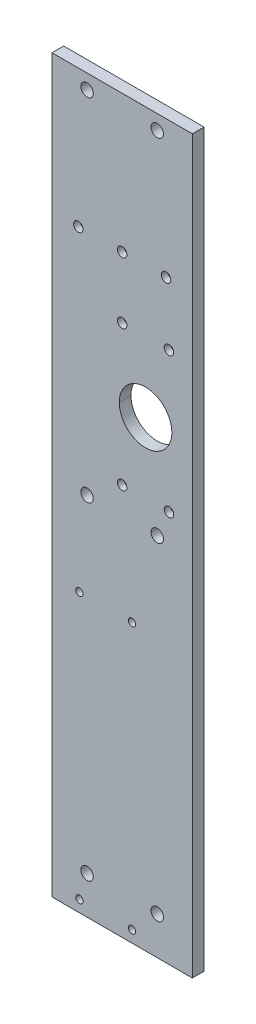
ISO-10303-21;
HEADER;
FILE_DESCRIPTION(('STEP AP214'),'2;1');
FILE_NAME('part.step','',(''),(''),'','','');
FILE_SCHEMA(('AUTOMOTIVE_DESIGN { 1 0 10303 214 1 1 1 1 }'));
ENDSEC;
DATA;
#1=APPLICATION_CONTEXT('core data for automotive mechanical design processes');
#2=APPLICATION_PROTOCOL_DEFINITION('international standard','automotive_design',2000,#1);
#3=PRODUCT_CONTEXT('',#1,'mechanical');
#4=PRODUCT('Part','Part','',(#3));
#5=PRODUCT_RELATED_PRODUCT_CATEGORY('part','',(#4));
#6=PRODUCT_DEFINITION_FORMATION('','',#4);
#7=PRODUCT_DEFINITION_CONTEXT('part definition',#1,'design');
#8=PRODUCT_DEFINITION('design','',#6,#7);
#9=PRODUCT_DEFINITION_SHAPE('','',#8);
#10=(LENGTH_UNIT() NAMED_UNIT(*) SI_UNIT(.MILLI.,.METRE.));
#11=(NAMED_UNIT(*) PLANE_ANGLE_UNIT() SI_UNIT($,.RADIAN.));
#12=(NAMED_UNIT(*) SI_UNIT($,.STERADIAN.) SOLID_ANGLE_UNIT());
#13=UNCERTAINTY_MEASURE_WITH_UNIT(LENGTH_MEASURE(1.E-05),#10,'distance_accuracy_value','');
#14=(GEOMETRIC_REPRESENTATION_CONTEXT(3) GLOBAL_UNCERTAINTY_ASSIGNED_CONTEXT((#13)) GLOBAL_UNIT_ASSIGNED_CONTEXT((#10,
#11,#12)) REPRESENTATION_CONTEXT('',''));
#15=CARTESIAN_POINT('',(0.,0.,0.));
#16=DIRECTION('',(0.,0.,1.));
#17=DIRECTION('',(1.,0.,0.));
#18=AXIS2_PLACEMENT_3D('',#15,#16,#17);
#19=CARTESIAN_POINT('',(-3.60955709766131E-13,180.975,-6.35000000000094));
#20=DIRECTION('',(0.,0.,-1.));
#21=DIRECTION('',(-1.,0.,0.));
#22=AXIS2_PLACEMENT_3D('',#19,#20,#21);
#23=CONICAL_SURFACE('',#22,10.3187500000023,0.714578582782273);
#24=CARTESIAN_POINT('',(-3.60955709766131E-13,180.975,-6.35000000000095));
#25=DIRECTION('',(0.,0.,-1.));
#26=DIRECTION('',(-1.,0.,0.));
#27=AXIS2_PLACEMENT_3D('',#24,#25,#26);
#28=CIRCLE('',#27,10.3187500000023);
#29=CARTESIAN_POINT('',(-3.60007979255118E-13,170.656249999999,-6.34999999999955));
#30=VERTEX_POINT('',#29);
#31=CARTESIAN_POINT('',(-3.61903440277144E-13,191.293750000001,-6.34999999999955));
#32=VERTEX_POINT('',#31);
#33=EDGE_CURVE('E685',#30,#32,#28,.T.);
#34=ORIENTED_EDGE('',*,*,#33,.T.);
#35=DIRECTION('',(0.,-0.655299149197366,0.755369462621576));
#36=VECTOR('',#35,1.);
#37=CARTESIAN_POINT('',(-3.61903634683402E-13,188.71565,-3.37819999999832));
#38=LINE('',#37,#36);
#39=CARTESIAN_POINT('',(-3.62062075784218E-13,186.13755,-0.40639999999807));
#40=VERTEX_POINT('',#39);
#41=EDGE_CURVE('E410',#32,#40,#38,.T.);
#42=ORIENTED_EDGE('',*,*,#41,.T.);
#43=CARTESIAN_POINT('',(-3.60955709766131E-13,180.975,-0.40639999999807));
#44=DIRECTION('',(0.,0.,-1.));
#45=DIRECTION('',(-1.,0.,0.));
#46=AXIS2_PLACEMENT_3D('',#43,#44,#45);
#47=CIRCLE('',#46,5.16254999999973);
#48=CARTESIAN_POINT('',(-3.60481552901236E-13,175.81245,-0.40639999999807));
#49=VERTEX_POINT('',#48);
#50=EDGE_CURVE('E700',#40,#49,#47,.F.);
#51=ORIENTED_EDGE('',*,*,#50,.T.);
#52=DIRECTION('',(0.,0.655299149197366,0.755369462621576));
#53=VECTOR('',#52,1.);
#54=CARTESIAN_POINT('',(-3.60955709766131E-13,173.23435,-3.37819999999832));
#55=LINE('',#54,#53);
#56=EDGE_CURVE('E407',#49,#30,#55,.F.);
#57=ORIENTED_EDGE('',*,*,#56,.T.);
#58=EDGE_LOOP('',(#34,#42,#51,#57));
#59=FACE_BOUND('',#58,.T.);
#60=ADVANCED_FACE('F16',(#59),#23,.F.);
#61=CARTESIAN_POINT('',(-3.60955709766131E-13,180.975,-6.34999999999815));
#62=DIRECTION('',(0.,0.,-1.));
#63=DIRECTION('',(-1.,0.,0.));
#64=AXIS2_PLACEMENT_3D('',#61,#62,#63);
#65=CONICAL_SURFACE('',#64,10.3187499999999,0.714578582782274);
#66=CARTESIAN_POINT('',(-3.60955709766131E-13,180.975,-0.40639999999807));
#67=DIRECTION('',(0.,0.,-1.));
#68=DIRECTION('',(-1.,0.,0.));
#69=AXIS2_PLACEMENT_3D('',#66,#67,#68);
#70=CIRCLE('',#69,5.16254999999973);
#71=EDGE_CURVE('E703',#49,#40,#70,.F.);
#72=ORIENTED_EDGE('',*,*,#71,.T.);
#73=ORIENTED_EDGE('',*,*,#41,.F.);
#74=CARTESIAN_POINT('',(-3.60955709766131E-13,180.975,-6.34999999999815));
#75=DIRECTION('',(0.,0.,-1.));
#76=DIRECTION('',(-1.,0.,0.));
#77=AXIS2_PLACEMENT_3D('',#74,#75,#76);
#78=CIRCLE('',#77,10.3187499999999);
#79=EDGE_CURVE('E682',#32,#30,#78,.T.);
#80=ORIENTED_EDGE('',*,*,#79,.T.);
#81=ORIENTED_EDGE('',*,*,#56,.F.);
#82=EDGE_LOOP('',(#72,#73,#80,#81));
#83=FACE_BOUND('',#82,.T.);
#84=ADVANCED_FACE('F751',(#83),#65,.F.);
#85=CARTESIAN_POINT('',(50.7999999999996,180.975,-6.35000000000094));
#86=DIRECTION('',(0.,0.,-1.));
#87=DIRECTION('',(-1.,0.,0.));
#88=AXIS2_PLACEMENT_3D('',#85,#86,#87);
#89=CONICAL_SURFACE('',#88,10.3187500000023,0.714578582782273);
#90=CARTESIAN_POINT('',(50.7999999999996,180.975,-6.35000000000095));
#91=DIRECTION('',(0.,0.,-1.));
#92=DIRECTION('',(-1.,0.,0.));
#93=AXIS2_PLACEMENT_3D('',#90,#91,#92);
#94=CIRCLE('',#93,10.3187500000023);
#95=CARTESIAN_POINT('',(50.7999999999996,170.656249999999,-6.34999999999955));
#96=VERTEX_POINT('',#95);
#97=CARTESIAN_POINT('',(50.7999999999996,191.293750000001,-6.34999999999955));
#98=VERTEX_POINT('',#97);
#99=EDGE_CURVE('E679',#96,#98,#94,.T.);
#100=ORIENTED_EDGE('',*,*,#99,.T.);
#101=DIRECTION('',(0.,-0.655299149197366,0.755369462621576));
#102=VECTOR('',#101,1.);
#103=CARTESIAN_POINT('',(50.7999999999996,188.71565,-3.37819999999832));
#104=LINE('',#103,#102);
#105=CARTESIAN_POINT('',(50.7999999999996,186.13755,-0.40639999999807));
#106=VERTEX_POINT('',#105);
#107=EDGE_CURVE('E405',#98,#106,#104,.T.);
#108=ORIENTED_EDGE('',*,*,#107,.T.);
#109=CARTESIAN_POINT('',(50.7999999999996,180.975,-0.40639999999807));
#110=DIRECTION('',(0.,0.,-1.));
#111=DIRECTION('',(-1.,0.,0.));
#112=AXIS2_PLACEMENT_3D('',#109,#110,#111);
#113=CIRCLE('',#112,5.16254999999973);
#114=CARTESIAN_POINT('',(50.7999999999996,175.81245,-0.40639999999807));
#115=VERTEX_POINT('',#114);
#116=EDGE_CURVE('E706',#106,#115,#113,.F.);
#117=ORIENTED_EDGE('',*,*,#116,.T.);
#118=DIRECTION('',(0.,0.655299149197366,0.755369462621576));
#119=VECTOR('',#118,1.);
#120=CARTESIAN_POINT('',(50.7999999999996,173.23435,-3.37819999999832));
#121=LINE('',#120,#119);
#122=EDGE_CURVE('E402',#115,#96,#121,.F.);
#123=ORIENTED_EDGE('',*,*,#122,.T.);
#124=EDGE_LOOP('',(#100,#108,#117,#123));
#125=FACE_BOUND('',#124,.T.);
#126=ADVANCED_FACE('F1047',(#125),#89,.F.);
#127=CARTESIAN_POINT('',(50.7999999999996,180.975,-6.34999999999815));
#128=DIRECTION('',(0.,0.,-1.));
#129=DIRECTION('',(-1.,0.,0.));
#130=AXIS2_PLACEMENT_3D('',#127,#128,#129);
#131=CONICAL_SURFACE('',#130,10.3187499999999,0.714578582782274);
#132=CARTESIAN_POINT('',(50.7999999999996,180.975,-0.40639999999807));
#133=DIRECTION('',(0.,0.,-1.));
#134=DIRECTION('',(-1.,0.,0.));
#135=AXIS2_PLACEMENT_3D('',#132,#133,#134);
#136=CIRCLE('',#135,5.16254999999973);
#137=EDGE_CURVE('E709',#115,#106,#136,.F.);
#138=ORIENTED_EDGE('',*,*,#137,.T.);
#139=ORIENTED_EDGE('',*,*,#107,.F.);
#140=CARTESIAN_POINT('',(50.7999999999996,180.975,-6.34999999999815));
#141=DIRECTION('',(0.,0.,-1.));
#142=DIRECTION('',(-1.,0.,0.));
#143=AXIS2_PLACEMENT_3D('',#140,#141,#142);
#144=CIRCLE('',#143,10.3187499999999);
#145=EDGE_CURVE('E676',#98,#96,#144,.T.);
#146=ORIENTED_EDGE('',*,*,#145,.T.);
#147=ORIENTED_EDGE('',*,*,#122,.F.);
#148=EDGE_LOOP('',(#138,#139,#146,#147));
#149=FACE_BOUND('',#148,.T.);
#150=ADVANCED_FACE('F1043',(#149),#131,.F.);
#151=CARTESIAN_POINT('',(-3.60955709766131E-13,28.575,-6.35000000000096));
#152=DIRECTION('',(0.,0.,-1.));
#153=DIRECTION('',(-1.,0.,0.));
#154=AXIS2_PLACEMENT_3D('',#151,#152,#153);
#155=CONICAL_SURFACE('',#154,10.3187500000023,0.714578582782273);
#156=CARTESIAN_POINT('',(-3.60955709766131E-13,28.575,-6.35000000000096));
#157=DIRECTION('',(0.,0.,-1.));
#158=DIRECTION('',(-1.,0.,0.));
#159=AXIS2_PLACEMENT_3D('',#156,#157,#158);
#160=CIRCLE('',#159,10.3187500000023);
#161=CARTESIAN_POINT('',(-3.60007979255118E-13,18.2562499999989,-6.34999999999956));
#162=VERTEX_POINT('',#161);
#163=CARTESIAN_POINT('',(-3.61903440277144E-13,38.8937500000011,-6.34999999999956));
#164=VERTEX_POINT('',#163);
#165=EDGE_CURVE('E673',#162,#164,#160,.T.);
#166=ORIENTED_EDGE('',*,*,#165,.T.);
#167=DIRECTION('',(0.,-0.655299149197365,0.755369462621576));
#168=VECTOR('',#167,1.);
#169=CARTESIAN_POINT('',(-3.61903634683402E-13,36.31565,-3.37819999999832));
#170=LINE('',#169,#168);
#171=CARTESIAN_POINT('',(-3.62062075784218E-13,33.7375499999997,-0.406399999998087));
#172=VERTEX_POINT('',#171);
#173=EDGE_CURVE('E400',#164,#172,#170,.T.);
#174=ORIENTED_EDGE('',*,*,#173,.T.);
#175=CARTESIAN_POINT('',(-3.60955709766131E-13,28.575,-0.406399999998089));
#176=DIRECTION('',(0.,0.,-1.));
#177=DIRECTION('',(-1.,0.,0.));
#178=AXIS2_PLACEMENT_3D('',#175,#176,#177);
#179=CIRCLE('',#178,5.16254999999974);
#180=CARTESIAN_POINT('',(-3.60481552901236E-13,23.4124500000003,-0.406399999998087));
#181=VERTEX_POINT('',#180);
#182=EDGE_CURVE('E694',#172,#181,#179,.F.);
#183=ORIENTED_EDGE('',*,*,#182,.T.);
#184=DIRECTION('',(0.,0.655299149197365,0.755369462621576));
#185=VECTOR('',#184,1.);
#186=CARTESIAN_POINT('',(-3.60955709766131E-13,20.83435,-3.37819999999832));
#187=LINE('',#186,#185);
#188=EDGE_CURVE('E397',#181,#162,#187,.F.);
#189=ORIENTED_EDGE('',*,*,#188,.T.);
#190=EDGE_LOOP('',(#166,#174,#183,#189));
#191=FACE_BOUND('',#190,.T.);
#192=ADVANCED_FACE('F1039',(#191),#155,.F.);
#193=CARTESIAN_POINT('',(-3.60955709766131E-13,28.575,-6.34999999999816));
#194=DIRECTION('',(0.,0.,-1.));
#195=DIRECTION('',(-1.,0.,0.));
#196=AXIS2_PLACEMENT_3D('',#193,#194,#195);
#197=CONICAL_SURFACE('',#196,10.3187499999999,0.714578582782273);
#198=CARTESIAN_POINT('',(-3.60955709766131E-13,28.575,-0.406399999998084));
#199=DIRECTION('',(0.,0.,-1.));
#200=DIRECTION('',(-1.,0.,0.));
#201=AXIS2_PLACEMENT_3D('',#198,#199,#200);
#202=CIRCLE('',#201,5.16254999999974);
#203=EDGE_CURVE('E697',#181,#172,#202,.F.);
#204=ORIENTED_EDGE('',*,*,#203,.T.);
#205=ORIENTED_EDGE('',*,*,#173,.F.);
#206=CARTESIAN_POINT('',(-3.60955709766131E-13,28.575,-6.34999999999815));
#207=DIRECTION('',(0.,0.,-1.));
#208=DIRECTION('',(-1.,0.,0.));
#209=AXIS2_PLACEMENT_3D('',#206,#207,#208);
#210=CIRCLE('',#209,10.3187499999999);
#211=EDGE_CURVE('E670',#164,#162,#210,.T.);
#212=ORIENTED_EDGE('',*,*,#211,.T.);
#213=ORIENTED_EDGE('',*,*,#188,.F.);
#214=EDGE_LOOP('',(#204,#205,#212,#213));
#215=FACE_BOUND('',#214,.T.);
#216=ADVANCED_FACE('F1035',(#215),#197,.F.);
#217=CARTESIAN_POINT('',(50.7999999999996,28.575,-6.35000000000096));
#218=DIRECTION('',(0.,0.,-1.));
#219=DIRECTION('',(-1.,0.,0.));
#220=AXIS2_PLACEMENT_3D('',#217,#218,#219);
#221=CONICAL_SURFACE('',#220,10.3187500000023,0.714578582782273);
#222=CARTESIAN_POINT('',(50.7999999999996,28.575,-6.35000000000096));
#223=DIRECTION('',(0.,0.,-1.));
#224=DIRECTION('',(-1.,0.,0.));
#225=AXIS2_PLACEMENT_3D('',#222,#223,#224);
#226=CIRCLE('',#225,10.3187500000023);
#227=CARTESIAN_POINT('',(50.7999999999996,18.2562499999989,-6.34999999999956));
#228=VERTEX_POINT('',#227);
#229=CARTESIAN_POINT('',(50.7999999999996,38.8937500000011,-6.34999999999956));
#230=VERTEX_POINT('',#229);
#231=EDGE_CURVE('E667',#228,#230,#226,.T.);
#232=ORIENTED_EDGE('',*,*,#231,.T.);
#233=DIRECTION('',(0.,-0.655299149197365,0.755369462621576));
#234=VECTOR('',#233,1.);
#235=CARTESIAN_POINT('',(50.7999999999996,36.31565,-3.37819999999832));
#236=LINE('',#235,#234);
#237=CARTESIAN_POINT('',(50.7999999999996,33.7375499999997,-0.406399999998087));
#238=VERTEX_POINT('',#237);
#239=EDGE_CURVE('E395',#230,#238,#236,.T.);
#240=ORIENTED_EDGE('',*,*,#239,.T.);
#241=CARTESIAN_POINT('',(50.7999999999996,28.575,-0.406399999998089));
#242=DIRECTION('',(0.,0.,-1.));
#243=DIRECTION('',(-1.,0.,0.));
#244=AXIS2_PLACEMENT_3D('',#241,#242,#243);
#245=CIRCLE('',#244,5.16254999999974);
#246=CARTESIAN_POINT('',(50.7999999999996,23.4124500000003,-0.406399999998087));
#247=VERTEX_POINT('',#246);
#248=EDGE_CURVE('E688',#238,#247,#245,.F.);
#249=ORIENTED_EDGE('',*,*,#248,.T.);
#250=DIRECTION('',(0.,0.655299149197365,0.755369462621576));
#251=VECTOR('',#250,1.);
#252=CARTESIAN_POINT('',(50.7999999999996,20.83435,-3.37819999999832));
#253=LINE('',#252,#251);
#254=EDGE_CURVE('E367',#247,#228,#253,.F.);
#255=ORIENTED_EDGE('',*,*,#254,.T.);
#256=EDGE_LOOP('',(#232,#240,#249,#255));
#257=FACE_BOUND('',#256,.T.);
#258=ADVANCED_FACE('F1031',(#257),#221,.F.);
#259=CARTESIAN_POINT('',(50.7999999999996,28.575,-6.34999999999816));
#260=DIRECTION('',(0.,0.,-1.));
#261=DIRECTION('',(-1.,0.,0.));
#262=AXIS2_PLACEMENT_3D('',#259,#260,#261);
#263=CONICAL_SURFACE('',#262,10.3187499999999,0.714578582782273);
#264=CARTESIAN_POINT('',(50.7999999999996,28.575,-0.406399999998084));
#265=DIRECTION('',(0.,0.,-1.));
#266=DIRECTION('',(-1.,0.,0.));
#267=AXIS2_PLACEMENT_3D('',#264,#265,#266);
#268=CIRCLE('',#267,5.16254999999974);
#269=EDGE_CURVE('E691',#247,#238,#268,.F.);
#270=ORIENTED_EDGE('',*,*,#269,.T.);
#271=ORIENTED_EDGE('',*,*,#239,.F.);
#272=CARTESIAN_POINT('',(50.7999999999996,28.575,-6.34999999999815));
#273=DIRECTION('',(0.,0.,-1.));
#274=DIRECTION('',(-1.,0.,0.));
#275=AXIS2_PLACEMENT_3D('',#272,#273,#274);
#276=CIRCLE('',#275,10.3187499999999);
#277=EDGE_CURVE('E664',#230,#228,#276,.T.);
#278=ORIENTED_EDGE('',*,*,#277,.T.);
#279=ORIENTED_EDGE('',*,*,#254,.F.);
#280=EDGE_LOOP('',(#270,#271,#278,#279));
#281=FACE_BOUND('',#280,.T.);
#282=ADVANCED_FACE('F1028',(#281),#263,.F.);
#283=CARTESIAN_POINT('',(47.625,247.65,-6.35000000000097));
#284=DIRECTION('',(0.,0.,-1.));
#285=DIRECTION('',(-1.,0.,0.));
#286=AXIS2_PLACEMENT_3D('',#283,#284,#285);
#287=CONICAL_SURFACE('',#286,10.3187499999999,0.714578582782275);
#288=CARTESIAN_POINT('',(47.625,247.65,-6.35000000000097));
#289=DIRECTION('',(0.,0.,-1.));
#290=DIRECTION('',(-1.,0.,0.));
#291=AXIS2_PLACEMENT_3D('',#288,#289,#290);
#292=CIRCLE('',#291,10.3187499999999);
#293=CARTESIAN_POINT('',(47.625,237.33125,-6.35000000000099));
#294=VERTEX_POINT('',#293);
#295=CARTESIAN_POINT('',(47.625,257.96875,-6.35000000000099));
#296=VERTEX_POINT('',#295);
#297=EDGE_CURVE('E365',#294,#296,#292,.T.);
#298=ORIENTED_EDGE('',*,*,#297,.T.);
#299=DIRECTION('',(0.,-0.655299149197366,0.755369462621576));
#300=VECTOR('',#299,1.);
#301=CARTESIAN_POINT('',(47.625,255.39065,-3.37820000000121));
#302=LINE('',#301,#300);
#303=CARTESIAN_POINT('',(47.625,252.81255,-0.406400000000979));
#304=VERTEX_POINT('',#303);
#305=EDGE_CURVE('E361',#296,#304,#302,.T.);
#306=ORIENTED_EDGE('',*,*,#305,.T.);
#307=CARTESIAN_POINT('',(47.625,247.65,-0.406400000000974));
#308=DIRECTION('',(0.,0.,-1.));
#309=DIRECTION('',(-1.,0.,0.));
#310=AXIS2_PLACEMENT_3D('',#307,#308,#309);
#311=CIRCLE('',#310,5.16254999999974);
#312=CARTESIAN_POINT('',(47.625,242.48745,-0.406400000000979));
#313=VERTEX_POINT('',#312);
#314=EDGE_CURVE('E364',#304,#313,#311,.F.);
#315=ORIENTED_EDGE('',*,*,#314,.T.);
#316=DIRECTION('',(0.,0.655299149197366,0.755369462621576));
#317=VECTOR('',#316,1.);
#318=CARTESIAN_POINT('',(47.625,239.90935,-3.37820000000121));
#319=LINE('',#318,#317);
#320=EDGE_CURVE('E355',#313,#294,#319,.F.);
#321=ORIENTED_EDGE('',*,*,#320,.T.);
#322=EDGE_LOOP('',(#298,#306,#315,#321));
#323=FACE_BOUND('',#322,.T.);
#324=ADVANCED_FACE('F363',(#323),#287,.F.);
#325=CARTESIAN_POINT('',(47.625,247.65,-6.35000000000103));
#326=DIRECTION('',(0.,0.,-1.));
#327=DIRECTION('',(-1.,0.,0.));
#328=AXIS2_PLACEMENT_3D('',#325,#326,#327);
#329=CONICAL_SURFACE('',#328,10.3187499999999,0.714578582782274);
#330=CARTESIAN_POINT('',(47.625,247.65,-0.406400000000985));
#331=DIRECTION('',(0.,0.,-1.));
#332=DIRECTION('',(-1.,0.,0.));
#333=AXIS2_PLACEMENT_3D('',#330,#331,#332);
#334=CIRCLE('',#333,5.16254999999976);
#335=EDGE_CURVE('E19',#313,#304,#334,.F.);
#336=ORIENTED_EDGE('',*,*,#335,.T.);
#337=ORIENTED_EDGE('',*,*,#305,.F.);
#338=CARTESIAN_POINT('',(47.625,247.65,-6.35000000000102));
#339=DIRECTION('',(0.,0.,-1.));
#340=DIRECTION('',(-1.,0.,0.));
#341=AXIS2_PLACEMENT_3D('',#338,#339,#340);
#342=CIRCLE('',#341,10.3187499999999);
#343=EDGE_CURVE('E661',#296,#294,#342,.T.);
#344=ORIENTED_EDGE('',*,*,#343,.T.);
#345=ORIENTED_EDGE('',*,*,#320,.F.);
#346=EDGE_LOOP('',(#336,#337,#344,#345));
#347=FACE_BOUND('',#346,.T.);
#348=ADVANCED_FACE('F373',(#347),#329,.F.);
#349=CARTESIAN_POINT('',(-1.15505827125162E-11,247.65,-6.35000000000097));
#350=DIRECTION('',(0.,0.,-1.));
#351=DIRECTION('',(-1.,0.,0.));
#352=AXIS2_PLACEMENT_3D('',#349,#350,#351);
#353=CONICAL_SURFACE('',#352,10.3187499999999,0.714578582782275);
#354=CARTESIAN_POINT('',(-1.15505827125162E-11,247.65,-6.35000000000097));
#355=DIRECTION('',(0.,0.,-1.));
#356=DIRECTION('',(-1.,0.,0.));
#357=AXIS2_PLACEMENT_3D('',#354,#355,#356);
#358=CIRCLE('',#357,10.3187499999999);
#359=CARTESIAN_POINT('',(-1.15496349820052E-11,237.33125,-6.35000000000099));
#360=VERTEX_POINT('',#359);
#361=CARTESIAN_POINT('',(-1.15515304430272E-11,257.96875,-6.35000000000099));
#362=VERTEX_POINT('',#361);
#363=EDGE_CURVE('E658',#360,#362,#358,.T.);
#364=ORIENTED_EDGE('',*,*,#363,.T.);
#365=DIRECTION('',(0.,-0.655299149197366,0.755369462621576));
#366=VECTOR('',#365,1.);
#367=CARTESIAN_POINT('',(-1.15515306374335E-11,255.39065,-3.37820000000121));
#368=LINE('',#367,#366);
#369=CARTESIAN_POINT('',(-1.15516890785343E-11,252.81255,-0.406400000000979));
#370=VERTEX_POINT('',#369);
#371=EDGE_CURVE('E390',#362,#370,#368,.T.);
#372=ORIENTED_EDGE('',*,*,#371,.T.);
#373=CARTESIAN_POINT('',(-1.15505827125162E-11,247.65,-0.406400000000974));
#374=DIRECTION('',(0.,0.,-1.));
#375=DIRECTION('',(-1.,0.,0.));
#376=AXIS2_PLACEMENT_3D('',#373,#374,#375);
#377=CIRCLE('',#376,5.16254999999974);
#378=CARTESIAN_POINT('',(-1.15501085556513E-11,242.48745,-0.406400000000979));
#379=VERTEX_POINT('',#378);
#380=EDGE_CURVE('E717',#370,#379,#377,.F.);
#381=ORIENTED_EDGE('',*,*,#380,.T.);
#382=DIRECTION('',(0.,0.655299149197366,0.755369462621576));
#383=VECTOR('',#382,1.);
#384=CARTESIAN_POINT('',(-1.15505827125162E-11,239.90935,-3.37820000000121));
#385=LINE('',#384,#383);
#386=EDGE_CURVE('E382',#379,#360,#385,.F.);
#387=ORIENTED_EDGE('',*,*,#386,.T.);
#388=EDGE_LOOP('',(#364,#372,#381,#387));
#389=FACE_BOUND('',#388,.T.);
#390=ADVANCED_FACE('F730',(#389),#353,.F.);
#391=CARTESIAN_POINT('',(-1.15505827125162E-11,247.65,-6.35000000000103));
#392=DIRECTION('',(0.,0.,-1.));
#393=DIRECTION('',(-1.,0.,0.));
#394=AXIS2_PLACEMENT_3D('',#391,#392,#393);
#395=CONICAL_SURFACE('',#394,10.3187499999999,0.714578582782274);
#396=CARTESIAN_POINT('',(-1.15505827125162E-11,247.65,-0.406400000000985));
#397=DIRECTION('',(0.,0.,-1.));
#398=DIRECTION('',(-1.,0.,0.));
#399=AXIS2_PLACEMENT_3D('',#396,#397,#398);
#400=CIRCLE('',#399,5.16254999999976);
#401=EDGE_CURVE('E372',#379,#370,#400,.F.);
#402=ORIENTED_EDGE('',*,*,#401,.T.);
#403=ORIENTED_EDGE('',*,*,#371,.F.);
#404=CARTESIAN_POINT('',(-1.15505827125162E-11,247.65,-6.35000000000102));
#405=DIRECTION('',(0.,0.,-1.));
#406=DIRECTION('',(-1.,0.,0.));
#407=AXIS2_PLACEMENT_3D('',#404,#405,#406);
#408=CIRCLE('',#407,10.3187499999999);
#409=EDGE_CURVE('E655',#362,#360,#408,.T.);
#410=ORIENTED_EDGE('',*,*,#409,.T.);
#411=ORIENTED_EDGE('',*,*,#386,.F.);
#412=EDGE_LOOP('',(#402,#403,#410,#411));
#413=FACE_BOUND('',#412,.T.);
#414=ADVANCED_FACE('F723',(#413),#395,.F.);
#415=CARTESIAN_POINT('',(-47.625,247.65,-6.35000000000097));
#416=DIRECTION('',(0.,0.,-1.));
#417=DIRECTION('',(-1.,0.,0.));
#418=AXIS2_PLACEMENT_3D('',#415,#416,#417);
#419=CONICAL_SURFACE('',#418,10.3187499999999,0.714578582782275);
#420=CARTESIAN_POINT('',(-47.625,247.65,-6.35000000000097));
#421=DIRECTION('',(0.,0.,-1.));
#422=DIRECTION('',(-1.,0.,0.));
#423=AXIS2_PLACEMENT_3D('',#420,#421,#422);
#424=CIRCLE('',#423,10.3187499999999);
#425=CARTESIAN_POINT('',(-47.625,237.33125,-6.35000000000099));
#426=VERTEX_POINT('',#425);
#427=CARTESIAN_POINT('',(-47.625,257.96875,-6.35000000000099));
#428=VERTEX_POINT('',#427);
#429=EDGE_CURVE('E653',#426,#428,#424,.T.);
#430=ORIENTED_EDGE('',*,*,#429,.T.);
#431=DIRECTION('',(0.,-0.655299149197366,0.755369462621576));
#432=VECTOR('',#431,1.);
#433=CARTESIAN_POINT('',(-47.625,255.39065,-3.37820000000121));
#434=LINE('',#433,#432);
#435=CARTESIAN_POINT('',(-47.625,252.81255,-0.406400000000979));
#436=VERTEX_POINT('',#435);
#437=EDGE_CURVE('E376',#428,#436,#434,.T.);
#438=ORIENTED_EDGE('',*,*,#437,.T.);
#439=CARTESIAN_POINT('',(-47.625,247.65,-0.406400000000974));
#440=DIRECTION('',(0.,0.,-1.));
#441=DIRECTION('',(-1.,0.,0.));
#442=AXIS2_PLACEMENT_3D('',#439,#440,#441);
#443=CIRCLE('',#442,5.16254999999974);
#444=CARTESIAN_POINT('',(-47.625,242.48745,-0.406400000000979));
#445=VERTEX_POINT('',#444);
#446=EDGE_CURVE('E712',#436,#445,#443,.F.);
#447=ORIENTED_EDGE('',*,*,#446,.T.);
#448=DIRECTION('',(0.,0.655299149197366,0.755369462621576));
#449=VECTOR('',#448,1.);
#450=CARTESIAN_POINT('',(-47.625,239.90935,-3.37820000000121));
#451=LINE('',#450,#449);
#452=EDGE_CURVE('E374',#445,#426,#451,.F.);
#453=ORIENTED_EDGE('',*,*,#452,.T.);
#454=EDGE_LOOP('',(#430,#438,#447,#453));
#455=FACE_BOUND('',#454,.T.);
#456=ADVANCED_FACE('F1016',(#455),#419,.F.);
#457=CARTESIAN_POINT('',(-47.625,247.65,-6.35000000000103));
#458=DIRECTION('',(0.,0.,-1.));
#459=DIRECTION('',(-1.,0.,0.));
#460=AXIS2_PLACEMENT_3D('',#457,#458,#459);
#461=CONICAL_SURFACE('',#460,10.3187499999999,0.714578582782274);
#462=CARTESIAN_POINT('',(-47.625,247.65,-0.406400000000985));
#463=DIRECTION('',(0.,0.,-1.));
#464=DIRECTION('',(-1.,0.,0.));
#465=AXIS2_PLACEMENT_3D('',#462,#463,#464);
#466=CIRCLE('',#465,5.16254999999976);
#467=EDGE_CURVE('E714',#445,#436,#466,.F.);
#468=ORIENTED_EDGE('',*,*,#467,.T.);
#469=ORIENTED_EDGE('',*,*,#437,.F.);
#470=CARTESIAN_POINT('',(-47.625,247.65,-6.35000000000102));
#471=DIRECTION('',(0.,0.,-1.));
#472=DIRECTION('',(-1.,0.,0.));
#473=AXIS2_PLACEMENT_3D('',#470,#471,#472);
#474=CIRCLE('',#473,10.3187499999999);
#475=EDGE_CURVE('E651',#428,#426,#474,.T.);
#476=ORIENTED_EDGE('',*,*,#475,.T.);
#477=ORIENTED_EDGE('',*,*,#452,.F.);
#478=EDGE_LOOP('',(#468,#469,#476,#477));
#479=FACE_BOUND('',#478,.T.);
#480=ADVANCED_FACE('F1013',(#479),#461,.F.);
#481=CARTESIAN_POINT('',(47.625,245.068725,-0.406400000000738));
#482=DIRECTION('',(0.,0.,1.));
#483=DIRECTION('',(1.,0.,0.));
#484=AXIS2_PLACEMENT_3D('',#481,#482,#483);
#485=PLANE('',#484);
#486=ORIENTED_EDGE('',*,*,#335,.F.);
#487=ORIENTED_EDGE('',*,*,#314,.F.);
#488=EDGE_LOOP('',(#486,#487));
#489=FACE_BOUND('',#488,.T.);
#490=CARTESIAN_POINT('',(47.625,247.65,-0.406400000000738));
#491=DIRECTION('',(0.,0.,1.));
#492=DIRECTION('',(1.,0.,0.));
#493=AXIS2_PLACEMENT_3D('',#490,#491,#492);
#494=CIRCLE('',#493,5.159375);
#495=CARTESIAN_POINT('',(42.465625,247.65,-0.406400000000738));
#496=VERTEX_POINT('',#495);
#497=CARTESIAN_POINT('',(52.784375,247.65,-0.406400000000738));
#498=VERTEX_POINT('',#497);
#499=EDGE_CURVE('E646',#496,#498,#494,.T.);
#500=ORIENTED_EDGE('',*,*,#499,.T.);
#501=CARTESIAN_POINT('',(47.625,247.65,-0.406400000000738));
#502=DIRECTION('',(0.,0.,1.));
#503=DIRECTION('',(1.,0.,0.));
#504=AXIS2_PLACEMENT_3D('',#501,#502,#503);
#505=CIRCLE('',#504,5.159375);
#506=EDGE_CURVE('E649',#498,#496,#505,.T.);
#507=ORIENTED_EDGE('',*,*,#506,.T.);
#508=EDGE_LOOP('',(#500,#507));
#509=FACE_BOUND('',#508,.T.);
#510=ADVANCED_FACE('F370',(#489,#509),#485,.F.);
#511=CARTESIAN_POINT('',(-1.15505827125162E-11,245.068725,-0.406400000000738));
#512=DIRECTION('',(0.,0.,1.));
#513=DIRECTION('',(1.,0.,0.));
#514=AXIS2_PLACEMENT_3D('',#511,#512,#513);
#515=PLANE('',#514);
#516=ORIENTED_EDGE('',*,*,#401,.F.);
#517=ORIENTED_EDGE('',*,*,#380,.F.);
#518=EDGE_LOOP('',(#516,#517));
#519=FACE_BOUND('',#518,.T.);
#520=CARTESIAN_POINT('',(-1.15505827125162E-11,247.65,-0.406400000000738));
#521=DIRECTION('',(0.,0.,1.));
#522=DIRECTION('',(1.,0.,0.));
#523=AXIS2_PLACEMENT_3D('',#520,#521,#522);
#524=CIRCLE('',#523,5.159375);
#525=CARTESIAN_POINT('',(-5.15937500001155,247.65,-0.406400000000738));
#526=VERTEX_POINT('',#525);
#527=CARTESIAN_POINT('',(5.15937499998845,247.65,-0.406400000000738));
#528=VERTEX_POINT('',#527);
#529=EDGE_CURVE('E639',#526,#528,#524,.T.);
#530=ORIENTED_EDGE('',*,*,#529,.T.);
#531=CARTESIAN_POINT('',(-1.15505827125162E-11,247.65,-0.406400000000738));
#532=DIRECTION('',(0.,0.,1.));
#533=DIRECTION('',(1.,0.,0.));
#534=AXIS2_PLACEMENT_3D('',#531,#532,#533);
#535=CIRCLE('',#534,5.159375);
#536=EDGE_CURVE('E643',#528,#526,#535,.T.);
#537=ORIENTED_EDGE('',*,*,#536,.T.);
#538=EDGE_LOOP('',(#530,#537));
#539=FACE_BOUND('',#538,.T.);
#540=ADVANCED_FACE('F727',(#519,#539),#515,.F.);
#541=CARTESIAN_POINT('',(-47.625,245.068725,-0.406400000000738));
#542=DIRECTION('',(0.,0.,1.));
#543=DIRECTION('',(1.,0.,0.));
#544=AXIS2_PLACEMENT_3D('',#541,#542,#543);
#545=PLANE('',#544);
#546=ORIENTED_EDGE('',*,*,#467,.F.);
#547=ORIENTED_EDGE('',*,*,#446,.F.);
#548=EDGE_LOOP('',(#546,#547));
#549=FACE_BOUND('',#548,.T.);
#550=CARTESIAN_POINT('',(-47.625,247.65,-0.406400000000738));
#551=DIRECTION('',(0.,0.,1.));
#552=DIRECTION('',(1.,0.,0.));
#553=AXIS2_PLACEMENT_3D('',#550,#551,#552);
#554=CIRCLE('',#553,5.159375);
#555=CARTESIAN_POINT('',(-52.784375,247.65,-0.406400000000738));
#556=VERTEX_POINT('',#555);
#557=CARTESIAN_POINT('',(-42.465625,247.65,-0.406400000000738));
#558=VERTEX_POINT('',#557);
#559=EDGE_CURVE('E632',#556,#558,#554,.T.);
#560=ORIENTED_EDGE('',*,*,#559,.T.);
#561=CARTESIAN_POINT('',(-47.625,247.65,-0.406400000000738));
#562=DIRECTION('',(0.,0.,1.));
#563=DIRECTION('',(1.,0.,0.));
#564=AXIS2_PLACEMENT_3D('',#561,#562,#563);
#565=CIRCLE('',#564,5.159375);
#566=EDGE_CURVE('E636',#558,#556,#565,.T.);
#567=ORIENTED_EDGE('',*,*,#566,.T.);
#568=EDGE_LOOP('',(#560,#567));
#569=FACE_BOUND('',#568,.T.);
#570=ADVANCED_FACE('F1004',(#549,#569),#545,.F.);
#571=CARTESIAN_POINT('',(50.7999999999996,178.393725,-0.40639999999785));
#572=DIRECTION('',(0.,0.,1.));
#573=DIRECTION('',(1.,0.,0.));
#574=AXIS2_PLACEMENT_3D('',#571,#572,#573);
#575=PLANE('',#574);
#576=ORIENTED_EDGE('',*,*,#137,.F.);
#577=ORIENTED_EDGE('',*,*,#116,.F.);
#578=EDGE_LOOP('',(#576,#577));
#579=FACE_BOUND('',#578,.T.);
#580=CARTESIAN_POINT('',(50.7999999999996,180.975,-0.40639999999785));
#581=DIRECTION('',(0.,0.,1.));
#582=DIRECTION('',(1.,0.,0.));
#583=AXIS2_PLACEMENT_3D('',#580,#581,#582);
#584=CIRCLE('',#583,5.159375);
#585=CARTESIAN_POINT('',(45.6406249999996,180.975,-0.40639999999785));
#586=VERTEX_POINT('',#585);
#587=CARTESIAN_POINT('',(55.9593749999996,180.975,-0.40639999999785));
#588=VERTEX_POINT('',#587);
#589=EDGE_CURVE('E550',#586,#588,#584,.T.);
#590=ORIENTED_EDGE('',*,*,#589,.T.);
#591=CARTESIAN_POINT('',(50.7999999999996,180.975,-0.40639999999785));
#592=DIRECTION('',(0.,0.,1.));
#593=DIRECTION('',(1.,0.,0.));
#594=AXIS2_PLACEMENT_3D('',#591,#592,#593);
#595=CIRCLE('',#594,5.159375);
#596=EDGE_CURVE('E546',#588,#586,#595,.T.);
#597=ORIENTED_EDGE('',*,*,#596,.T.);
#598=EDGE_LOOP('',(#590,#597));
#599=FACE_BOUND('',#598,.T.);
#600=ADVANCED_FACE('F757',(#579,#599),#575,.F.);
#601=CARTESIAN_POINT('',(-3.60955709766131E-13,178.393725,-0.40639999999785));
#602=DIRECTION('',(0.,0.,1.));
#603=DIRECTION('',(1.,0.,0.));
#604=AXIS2_PLACEMENT_3D('',#601,#602,#603);
#605=PLANE('',#604);
#606=ORIENTED_EDGE('',*,*,#71,.F.);
#607=ORIENTED_EDGE('',*,*,#50,.F.);
#608=EDGE_LOOP('',(#606,#607));
#609=FACE_BOUND('',#608,.T.);
#610=CARTESIAN_POINT('',(-3.60955709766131E-13,180.975,-0.40639999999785));
#611=DIRECTION('',(0.,0.,1.));
#612=DIRECTION('',(1.,0.,0.));
#613=AXIS2_PLACEMENT_3D('',#610,#611,#612);
#614=CIRCLE('',#613,5.159375);
#615=CARTESIAN_POINT('',(-5.15937500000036,180.975,-0.40639999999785));
#616=VERTEX_POINT('',#615);
#617=CARTESIAN_POINT('',(5.15937499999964,180.975,-0.40639999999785));
#618=VERTEX_POINT('',#617);
#619=EDGE_CURVE('E542',#616,#618,#614,.T.);
#620=ORIENTED_EDGE('',*,*,#619,.T.);
#621=CARTESIAN_POINT('',(-3.60955709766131E-13,180.975,-0.40639999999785));
#622=DIRECTION('',(0.,0.,1.));
#623=DIRECTION('',(1.,0.,0.));
#624=AXIS2_PLACEMENT_3D('',#621,#622,#623);
#625=CIRCLE('',#624,5.159375);
#626=EDGE_CURVE('E538',#618,#616,#625,.T.);
#627=ORIENTED_EDGE('',*,*,#626,.T.);
#628=EDGE_LOOP('',(#620,#627));
#629=FACE_BOUND('',#628,.T.);
#630=ADVANCED_FACE('F753',(#609,#629),#605,.F.);
#631=CARTESIAN_POINT('',(-3.60955709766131E-13,25.993725,-0.40639999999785));
#632=DIRECTION('',(0.,0.,1.));
#633=DIRECTION('',(1.,0.,0.));
#634=AXIS2_PLACEMENT_3D('',#631,#632,#633);
#635=PLANE('',#634);
#636=ORIENTED_EDGE('',*,*,#203,.F.);
#637=ORIENTED_EDGE('',*,*,#182,.F.);
#638=EDGE_LOOP('',(#636,#637));
#639=FACE_BOUND('',#638,.T.);
#640=CARTESIAN_POINT('',(-3.60955709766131E-13,28.575,-0.40639999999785));
#641=DIRECTION('',(0.,0.,1.));
#642=DIRECTION('',(1.,0.,0.));
#643=AXIS2_PLACEMENT_3D('',#640,#641,#642);
#644=CIRCLE('',#643,5.159375);
#645=CARTESIAN_POINT('',(-5.15937500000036,28.575,-0.40639999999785));
#646=VERTEX_POINT('',#645);
#647=CARTESIAN_POINT('',(5.15937499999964,28.575,-0.40639999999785));
#648=VERTEX_POINT('',#647);
#649=EDGE_CURVE('E534',#646,#648,#644,.T.);
#650=ORIENTED_EDGE('',*,*,#649,.T.);
#651=CARTESIAN_POINT('',(-3.60955709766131E-13,28.575,-0.40639999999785));
#652=DIRECTION('',(0.,0.,1.));
#653=DIRECTION('',(1.,0.,0.));
#654=AXIS2_PLACEMENT_3D('',#651,#652,#653);
#655=CIRCLE('',#654,5.159375);
#656=EDGE_CURVE('E530',#648,#646,#655,.T.);
#657=ORIENTED_EDGE('',*,*,#656,.T.);
#658=EDGE_LOOP('',(#650,#657));
#659=FACE_BOUND('',#658,.T.);
#660=ADVANCED_FACE('F756',(#639,#659),#635,.F.);
#661=CARTESIAN_POINT('',(50.7999999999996,25.993725,-0.40639999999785));
#662=DIRECTION('',(0.,0.,1.));
#663=DIRECTION('',(1.,0.,0.));
#664=AXIS2_PLACEMENT_3D('',#661,#662,#663);
#665=PLANE('',#664);
#666=ORIENTED_EDGE('',*,*,#269,.F.);
#667=ORIENTED_EDGE('',*,*,#248,.F.);
#668=EDGE_LOOP('',(#666,#667));
#669=FACE_BOUND('',#668,.T.);
#670=CARTESIAN_POINT('',(50.7999999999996,28.575,-0.40639999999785));
#671=DIRECTION('',(0.,0.,1.));
#672=DIRECTION('',(1.,0.,0.));
#673=AXIS2_PLACEMENT_3D('',#670,#671,#672);
#674=CIRCLE('',#673,5.159375);
#675=CARTESIAN_POINT('',(45.6406249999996,28.575,-0.40639999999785));
#676=VERTEX_POINT('',#675);
#677=CARTESIAN_POINT('',(55.9593749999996,28.575,-0.40639999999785));
#678=VERTEX_POINT('',#677);
#679=EDGE_CURVE('E526',#676,#678,#674,.T.);
#680=ORIENTED_EDGE('',*,*,#679,.T.);
#681=CARTESIAN_POINT('',(50.7999999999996,28.575,-0.40639999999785));
#682=DIRECTION('',(0.,0.,1.));
#683=DIRECTION('',(1.,0.,0.));
#684=AXIS2_PLACEMENT_3D('',#681,#682,#683);
#685=CIRCLE('',#684,5.159375);
#686=EDGE_CURVE('E522',#678,#676,#685,.T.);
#687=ORIENTED_EDGE('',*,*,#686,.T.);
#688=EDGE_LOOP('',(#680,#687));
#689=FACE_BOUND('',#688,.T.);
#690=ADVANCED_FACE('F736',(#669,#689),#665,.F.);
#691=CARTESIAN_POINT('',(75.4633999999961,206.375,-6.35000000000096));
#692=DIRECTION('',(0.,0.,1.));
#693=DIRECTION('',(1.,0.,0.));
#694=AXIS2_PLACEMENT_3D('',#691,#692,#693);
#695=PLANE('',#694);
#696=DIRECTION('',(0.,1.,0.));
#697=VECTOR('',#696,1.);
#698=CARTESIAN_POINT('',(76.1999999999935,206.375,-6.35000000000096));
#699=LINE('',#698,#697);
#700=CARTESIAN_POINT('',(76.1999999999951,396.875,-6.34999999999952));
#701=VERTEX_POINT('',#700);
#702=CARTESIAN_POINT('',(76.1999999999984,-396.875,-6.34999999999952));
#703=VERTEX_POINT('',#702);
#704=EDGE_CURVE('E521',#701,#703,#699,.F.);
#705=ORIENTED_EDGE('',*,*,#704,.T.);
#706=DIRECTION('',(1.,0.,0.));
#707=VECTOR('',#706,1.);
#708=CARTESIAN_POINT('',(0.,-396.875,-6.34999999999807));
#709=LINE('',#708,#707);
#710=CARTESIAN_POINT('',(-76.2,-396.875,-6.3499999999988));
#711=VERTEX_POINT('',#710);
#712=EDGE_CURVE('E1393',#703,#711,#709,.F.);
#713=ORIENTED_EDGE('',*,*,#712,.T.);
#714=DIRECTION('',(0.,1.,0.));
#715=VECTOR('',#714,1.);
#716=CARTESIAN_POINT('',(-76.2,207.772,-6.34999999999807));
#717=LINE('',#716,#715);
#718=CARTESIAN_POINT('',(-76.2,396.875,-6.3499999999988));
#719=VERTEX_POINT('',#718);
#720=EDGE_CURVE('E1400',#711,#719,#717,.T.);
#721=ORIENTED_EDGE('',*,*,#720,.T.);
#722=DIRECTION('',(1.,0.,0.));
#723=VECTOR('',#722,1.);
#724=CARTESIAN_POINT('',(75.4633999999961,396.875,-6.34999999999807));
#725=LINE('',#724,#723);
#726=EDGE_CURVE('E1405',#719,#701,#725,.T.);
#727=ORIENTED_EDGE('',*,*,#726,.T.);
#728=EDGE_LOOP('',(#705,#713,#721,#727));
#729=FACE_BOUND('',#728,.T.);
#730=CARTESIAN_POINT('',(25.3999999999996,104.775,-6.34999999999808));
#731=DIRECTION('',(0.,0.,1.));
#732=DIRECTION('',(1.,0.,0.));
#733=AXIS2_PLACEMENT_3D('',#730,#731,#732);
#734=CIRCLE('',#733,28.575);
#735=CARTESIAN_POINT('',(53.9749999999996,104.775,-6.34999999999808));
#736=VERTEX_POINT('',#735);
#737=CARTESIAN_POINT('',(-3.17500000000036,104.775,-6.34999999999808));
#738=VERTEX_POINT('',#737);
#739=EDGE_CURVE('E554',#736,#738,#734,.T.);
#740=ORIENTED_EDGE('',*,*,#739,.T.);
#741=CARTESIAN_POINT('',(25.3999999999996,104.775,-6.34999999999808));
#742=DIRECTION('',(0.,0.,1.));
#743=DIRECTION('',(1.,0.,0.));
#744=AXIS2_PLACEMENT_3D('',#741,#742,#743);
#745=CIRCLE('',#744,28.575);
#746=EDGE_CURVE('E558',#738,#736,#745,.T.);
#747=ORIENTED_EDGE('',*,*,#746,.T.);
#748=EDGE_LOOP('',(#740,#747));
#749=FACE_BOUND('',#748,.T.);
#750=CARTESIAN_POINT('',(-46.4312000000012,-95.2500000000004,-6.35000000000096));
#751=DIRECTION('',(0.,0.,1.));
#752=DIRECTION('',(1.,0.,0.));
#753=AXIS2_PLACEMENT_3D('',#750,#751,#752);
#754=CIRCLE('',#753,3.96875);
#755=CARTESIAN_POINT('',(-50.3999500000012,-95.2500000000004,-6.34999999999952));
#756=VERTEX_POINT('',#755);
#757=CARTESIAN_POINT('',(-42.4624500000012,-95.2500000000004,-6.34999999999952));
#758=VERTEX_POINT('',#757);
#759=EDGE_CURVE('E562',#756,#758,#754,.T.);
#760=ORIENTED_EDGE('',*,*,#759,.T.);
#761=CARTESIAN_POINT('',(-46.4312000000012,-95.2500000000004,-6.34999999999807));
#762=DIRECTION('',(0.,0.,1.));
#763=DIRECTION('',(1.,0.,0.));
#764=AXIS2_PLACEMENT_3D('',#761,#762,#763);
#765=CIRCLE('',#764,3.96875);
#766=EDGE_CURVE('E566',#758,#756,#765,.T.);
#767=ORIENTED_EDGE('',*,*,#766,.T.);
#768=EDGE_LOOP('',(#760,#767));
#769=FACE_BOUND('',#768,.T.);
#770=CARTESIAN_POINT('',(10.7187999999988,-95.2500000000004,-6.35000000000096));
#771=DIRECTION('',(0.,0.,-1.));
#772=DIRECTION('',(-1.,0.,0.));
#773=AXIS2_PLACEMENT_3D('',#770,#771,#772);
#774=CIRCLE('',#773,3.96875);
#775=CARTESIAN_POINT('',(14.6875499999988,-95.2500000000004,-6.34999999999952));
#776=VERTEX_POINT('',#775);
#777=CARTESIAN_POINT('',(6.75004999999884,-95.2500000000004,-6.34999999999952));
#778=VERTEX_POINT('',#777);
#779=EDGE_CURVE('E569',#776,#778,#774,.F.);
#780=ORIENTED_EDGE('',*,*,#779,.T.);
#781=CARTESIAN_POINT('',(10.7187999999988,-95.2500000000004,-6.34999999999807));
#782=DIRECTION('',(0.,0.,-1.));
#783=DIRECTION('',(-1.,0.,0.));
#784=AXIS2_PLACEMENT_3D('',#781,#782,#783);
#785=CIRCLE('',#784,3.96875);
#786=EDGE_CURVE('E573',#778,#776,#785,.F.);
#787=ORIENTED_EDGE('',*,*,#786,.T.);
#788=EDGE_LOOP('',(#780,#787));
#789=FACE_BOUND('',#788,.T.);
#790=CARTESIAN_POINT('',(-46.4312000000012,-384.175,-6.35000000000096));
#791=DIRECTION('',(0.,0.,1.));
#792=DIRECTION('',(1.,0.,0.));
#793=AXIS2_PLACEMENT_3D('',#790,#791,#792);
#794=CIRCLE('',#793,3.96875);
#795=CARTESIAN_POINT('',(-50.3999500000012,-384.175,-6.34999999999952));
#796=VERTEX_POINT('',#795);
#797=CARTESIAN_POINT('',(-42.4624500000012,-384.175,-6.34999999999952));
#798=VERTEX_POINT('',#797);
#799=EDGE_CURVE('E576',#796,#798,#794,.T.);
#800=ORIENTED_EDGE('',*,*,#799,.T.);
#801=CARTESIAN_POINT('',(-46.4312000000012,-384.175,-6.34999999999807));
#802=DIRECTION('',(0.,0.,1.));
#803=DIRECTION('',(1.,0.,0.));
#804=AXIS2_PLACEMENT_3D('',#801,#802,#803);
#805=CIRCLE('',#804,3.96875);
#806=EDGE_CURVE('E580',#798,#796,#805,.T.);
#807=ORIENTED_EDGE('',*,*,#806,.T.);
#808=EDGE_LOOP('',(#800,#807));
#809=FACE_BOUND('',#808,.T.);
#810=CARTESIAN_POINT('',(10.7187999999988,-384.175,-6.35000000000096));
#811=DIRECTION('',(0.,0.,-1.));
#812=DIRECTION('',(-1.,0.,0.));
#813=AXIS2_PLACEMENT_3D('',#810,#811,#812);
#814=CIRCLE('',#813,3.96875);
#815=CARTESIAN_POINT('',(14.6875499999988,-384.175,-6.34999999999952));
#816=VERTEX_POINT('',#815);
#817=CARTESIAN_POINT('',(6.75004999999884,-384.175,-6.34999999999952));
#818=VERTEX_POINT('',#817);
#819=EDGE_CURVE('E583',#816,#818,#814,.F.);
#820=ORIENTED_EDGE('',*,*,#819,.T.);
#821=CARTESIAN_POINT('',(10.7187999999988,-384.175,-6.34999999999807));
#822=DIRECTION('',(0.,0.,-1.));
#823=DIRECTION('',(-1.,0.,0.));
#824=AXIS2_PLACEMENT_3D('',#821,#822,#823);
#825=CIRCLE('',#824,3.96875);
#826=EDGE_CURVE('E587',#818,#816,#825,.F.);
#827=ORIENTED_EDGE('',*,*,#826,.T.);
#828=EDGE_LOOP('',(#820,#827));
#829=FACE_BOUND('',#828,.T.);
#830=CARTESIAN_POINT('',(-38.1000000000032,-355.6,-6.35000000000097));
#831=DIRECTION('',(0.,0.,1.));
#832=DIRECTION('',(1.,0.,0.));
#833=AXIS2_PLACEMENT_3D('',#830,#831,#832);
#834=CIRCLE('',#833,6.746875);
#835=CARTESIAN_POINT('',(-31.3531250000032,-355.6,-6.35000000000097));
#836=VERTEX_POINT('',#835);
#837=CARTESIAN_POINT('',(-44.8468750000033,-355.6,-6.35000000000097));
#838=VERTEX_POINT('',#837);
#839=EDGE_CURVE('E594',#836,#838,#834,.T.);
#840=ORIENTED_EDGE('',*,*,#839,.T.);
#841=CARTESIAN_POINT('',(-38.1000000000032,-355.6,-6.35000000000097));
#842=DIRECTION('',(0.,0.,1.));
#843=DIRECTION('',(1.,0.,0.));
#844=AXIS2_PLACEMENT_3D('',#841,#842,#843);
#845=CIRCLE('',#844,6.746875);
#846=EDGE_CURVE('E590',#838,#836,#845,.T.);
#847=ORIENTED_EDGE('',*,*,#846,.T.);
#848=EDGE_LOOP('',(#840,#847));
#849=FACE_BOUND('',#848,.T.);
#850=CARTESIAN_POINT('',(38.0999999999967,-355.6,-6.35000000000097));
#851=DIRECTION('',(0.,0.,1.));
#852=DIRECTION('',(1.,0.,0.));
#853=AXIS2_PLACEMENT_3D('',#850,#851,#852);
#854=CIRCLE('',#853,6.746875);
#855=CARTESIAN_POINT('',(44.8468749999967,-355.6,-6.35000000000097));
#856=VERTEX_POINT('',#855);
#857=CARTESIAN_POINT('',(31.3531249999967,-355.6,-6.35000000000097));
#858=VERTEX_POINT('',#857);
#859=EDGE_CURVE('E601',#856,#858,#854,.T.);
#860=ORIENTED_EDGE('',*,*,#859,.T.);
#861=CARTESIAN_POINT('',(38.0999999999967,-355.6,-6.35000000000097));
#862=DIRECTION('',(0.,0.,1.));
#863=DIRECTION('',(1.,0.,0.));
#864=AXIS2_PLACEMENT_3D('',#861,#862,#863);
#865=CIRCLE('',#864,6.746875);
#866=EDGE_CURVE('E597',#858,#856,#865,.T.);
#867=ORIENTED_EDGE('',*,*,#866,.T.);
#868=EDGE_LOOP('',(#860,#867));
#869=FACE_BOUND('',#868,.T.);
#870=CARTESIAN_POINT('',(-38.1000000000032,0.,-6.35000000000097));
#871=DIRECTION('',(0.,0.,1.));
#872=DIRECTION('',(1.,0.,0.));
#873=AXIS2_PLACEMENT_3D('',#870,#871,#872);
#874=CIRCLE('',#873,6.746875);
#875=CARTESIAN_POINT('',(-31.3531250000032,0.,-6.35000000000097));
#876=VERTEX_POINT('',#875);
#877=CARTESIAN_POINT('',(-44.8468750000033,0.,-6.35000000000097));
#878=VERTEX_POINT('',#877);
#879=EDGE_CURVE('E608',#876,#878,#874,.T.);
#880=ORIENTED_EDGE('',*,*,#879,.T.);
#881=CARTESIAN_POINT('',(-38.1000000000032,0.,-6.35000000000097));
#882=DIRECTION('',(0.,0.,1.));
#883=DIRECTION('',(1.,0.,0.));
#884=AXIS2_PLACEMENT_3D('',#881,#882,#883);
#885=CIRCLE('',#884,6.746875);
#886=EDGE_CURVE('E604',#878,#876,#885,.T.);
#887=ORIENTED_EDGE('',*,*,#886,.T.);
#888=EDGE_LOOP('',(#880,#887));
#889=FACE_BOUND('',#888,.T.);
#890=CARTESIAN_POINT('',(38.0999999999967,0.,-6.35000000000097));
#891=DIRECTION('',(0.,0.,1.));
#892=DIRECTION('',(1.,0.,0.));
#893=AXIS2_PLACEMENT_3D('',#890,#891,#892);
#894=CIRCLE('',#893,6.746875);
#895=CARTESIAN_POINT('',(44.8468749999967,0.,-6.35000000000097));
#896=VERTEX_POINT('',#895);
#897=CARTESIAN_POINT('',(31.3531249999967,0.,-6.35000000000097));
#898=VERTEX_POINT('',#897);
#899=EDGE_CURVE('E615',#896,#898,#894,.T.);
#900=ORIENTED_EDGE('',*,*,#899,.T.);
#901=CARTESIAN_POINT('',(38.0999999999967,0.,-6.35000000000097));
#902=DIRECTION('',(0.,0.,1.));
#903=DIRECTION('',(1.,0.,0.));
#904=AXIS2_PLACEMENT_3D('',#901,#902,#903);
#905=CIRCLE('',#904,6.746875);
#906=EDGE_CURVE('E611',#898,#896,#905,.T.);
#907=ORIENTED_EDGE('',*,*,#906,.T.);
#908=EDGE_LOOP('',(#900,#907));
#909=FACE_BOUND('',#908,.T.);
#910=CARTESIAN_POINT('',(38.0999999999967,381.,-6.35000000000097));
#911=DIRECTION('',(0.,0.,1.));
#912=DIRECTION('',(1.,0.,0.));
#913=AXIS2_PLACEMENT_3D('',#910,#911,#912);
#914=CIRCLE('',#913,6.746875);
#915=CARTESIAN_POINT('',(44.8468749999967,381.,-6.35000000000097));
#916=VERTEX_POINT('',#915);
#917=CARTESIAN_POINT('',(31.3531249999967,381.,-6.35000000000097));
#918=VERTEX_POINT('',#917);
#919=EDGE_CURVE('E622',#916,#918,#914,.T.);
#920=ORIENTED_EDGE('',*,*,#919,.T.);
#921=CARTESIAN_POINT('',(38.0999999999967,381.,-6.35000000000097));
#922=DIRECTION('',(0.,0.,1.));
#923=DIRECTION('',(1.,0.,0.));
#924=AXIS2_PLACEMENT_3D('',#921,#922,#923);
#925=CIRCLE('',#924,6.746875);
#926=EDGE_CURVE('E618',#918,#916,#925,.T.);
#927=ORIENTED_EDGE('',*,*,#926,.T.);
#928=EDGE_LOOP('',(#920,#927));
#929=FACE_BOUND('',#928,.T.);
#930=CARTESIAN_POINT('',(-38.1000000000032,381.,-6.35000000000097));
#931=DIRECTION('',(0.,0.,1.));
#932=DIRECTION('',(1.,0.,0.));
#933=AXIS2_PLACEMENT_3D('',#930,#931,#932);
#934=CIRCLE('',#933,6.746875);
#935=CARTESIAN_POINT('',(-31.3531250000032,381.,-6.35000000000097));
#936=VERTEX_POINT('',#935);
#937=CARTESIAN_POINT('',(-44.8468750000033,381.,-6.35000000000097));
#938=VERTEX_POINT('',#937);
#939=EDGE_CURVE('E629',#936,#938,#934,.T.);
#940=ORIENTED_EDGE('',*,*,#939,.T.);
#941=CARTESIAN_POINT('',(-38.1000000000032,381.,-6.35000000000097));
#942=DIRECTION('',(0.,0.,1.));
#943=DIRECTION('',(1.,0.,0.));
#944=AXIS2_PLACEMENT_3D('',#941,#942,#943);
#945=CIRCLE('',#944,6.746875);
#946=EDGE_CURVE('E625',#938,#936,#945,.T.);
#947=ORIENTED_EDGE('',*,*,#946,.T.);
#948=EDGE_LOOP('',(#940,#947));
#949=FACE_BOUND('',#948,.T.);
#950=ORIENTED_EDGE('',*,*,#429,.F.);
#951=ORIENTED_EDGE('',*,*,#475,.F.);
#952=EDGE_LOOP('',(#950,#951));
#953=FACE_BOUND('',#952,.T.);
#954=ORIENTED_EDGE('',*,*,#363,.F.);
#955=ORIENTED_EDGE('',*,*,#409,.F.);
#956=EDGE_LOOP('',(#954,#955));
#957=FACE_BOUND('',#956,.T.);
#958=ORIENTED_EDGE('',*,*,#297,.F.);
#959=ORIENTED_EDGE('',*,*,#343,.F.);
#960=EDGE_LOOP('',(#958,#959));
#961=FACE_BOUND('',#960,.T.);
#962=ORIENTED_EDGE('',*,*,#231,.F.);
#963=ORIENTED_EDGE('',*,*,#277,.F.);
#964=EDGE_LOOP('',(#962,#963));
#965=FACE_BOUND('',#964,.T.);
#966=ORIENTED_EDGE('',*,*,#165,.F.);
#967=ORIENTED_EDGE('',*,*,#211,.F.);
#968=EDGE_LOOP('',(#966,#967));
#969=FACE_BOUND('',#968,.T.);
#970=ORIENTED_EDGE('',*,*,#99,.F.);
#971=ORIENTED_EDGE('',*,*,#145,.F.);
#972=EDGE_LOOP('',(#970,#971));
#973=FACE_BOUND('',#972,.T.);
#974=ORIENTED_EDGE('',*,*,#33,.F.);
#975=ORIENTED_EDGE('',*,*,#79,.F.);
#976=EDGE_LOOP('',(#974,#975));
#977=FACE_BOUND('',#976,.T.);
#978=ADVANCED_FACE('F732',(#729,#749,#769,#789,#809,#829,#849,#869,#889,#909,#929,#949,#953,
#957,#961,#965,#969,#973,#977),#695,.F.);
#979=CARTESIAN_POINT('',(47.625,247.65,1.92462712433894E-12));
#980=DIRECTION('',(0.,0.,1.));
#981=DIRECTION('',(1.,0.,0.));
#982=AXIS2_PLACEMENT_3D('',#979,#980,#981);
#983=CYLINDRICAL_SURFACE('',#982,5.159375);
#984=CARTESIAN_POINT('',(47.625,247.65,6.35000000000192));
#985=DIRECTION('',(0.,0.,1.));
#986=DIRECTION('',(1.,0.,0.));
#987=AXIS2_PLACEMENT_3D('',#984,#985,#986);
#988=CIRCLE('',#987,5.159375);
#989=CARTESIAN_POINT('',(52.784375,247.65,6.35000000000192));
#990=VERTEX_POINT('',#989);
#991=CARTESIAN_POINT('',(42.465625,247.65,6.35000000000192));
#992=VERTEX_POINT('',#991);
#993=EDGE_CURVE('E518',#990,#992,#988,.T.);
#994=ORIENTED_EDGE('',*,*,#993,.T.);
#995=DIRECTION('',(0.,0.,1.));
#996=VECTOR('',#995,1.);
#997=CARTESIAN_POINT('',(42.465625,247.65,1.92462712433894E-12));
#998=LINE('',#997,#996);
#999=EDGE_CURVE('E385',#992,#496,#998,.F.);
#1000=ORIENTED_EDGE('',*,*,#999,.T.);
#1001=ORIENTED_EDGE('',*,*,#506,.F.);
#1002=DIRECTION('',(0.,0.,1.));
#1003=VECTOR('',#1002,1.);
#1004=CARTESIAN_POINT('',(52.784375,247.65,1.92462712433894E-12));
#1005=LINE('',#1004,#1003);
#1006=EDGE_CURVE('E645',#498,#990,#1005,.T.);
#1007=ORIENTED_EDGE('',*,*,#1006,.T.);
#1008=EDGE_LOOP('',(#994,#1000,#1001,#1007));
#1009=FACE_BOUND('',#1008,.T.);
#1010=ADVANCED_FACE('F735',(#1009),#983,.F.);
#1011=CARTESIAN_POINT('',(47.625,247.65,1.92462712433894E-12));
#1012=DIRECTION('',(0.,0.,1.));
#1013=DIRECTION('',(1.,0.,0.));
#1014=AXIS2_PLACEMENT_3D('',#1011,#1012,#1013);
#1015=CYLINDRICAL_SURFACE('',#1014,5.159375);
#1016=ORIENTED_EDGE('',*,*,#499,.F.);
#1017=ORIENTED_EDGE('',*,*,#999,.F.);
#1018=CARTESIAN_POINT('',(47.625,247.65,6.35000000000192));
#1019=DIRECTION('',(0.,0.,1.));
#1020=DIRECTION('',(1.,0.,0.));
#1021=AXIS2_PLACEMENT_3D('',#1018,#1019,#1020);
#1022=CIRCLE('',#1021,5.159375);
#1023=EDGE_CURVE('E515',#992,#990,#1022,.T.);
#1024=ORIENTED_EDGE('',*,*,#1023,.T.);
#1025=ORIENTED_EDGE('',*,*,#1006,.F.);
#1026=EDGE_LOOP('',(#1016,#1017,#1024,#1025));
#1027=FACE_BOUND('',#1026,.T.);
#1028=ADVANCED_FACE('F832',(#1027),#1015,.F.);
#1029=CARTESIAN_POINT('',(-1.15505827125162E-11,247.65,1.92462712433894E-12));
#1030=DIRECTION('',(0.,0.,1.));
#1031=DIRECTION('',(1.,0.,0.));
#1032=AXIS2_PLACEMENT_3D('',#1029,#1030,#1031);
#1033=CYLINDRICAL_SURFACE('',#1032,5.159375);
#1034=CARTESIAN_POINT('',(-1.15505827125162E-11,247.65,6.35000000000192));
#1035=DIRECTION('',(0.,0.,1.));
#1036=DIRECTION('',(1.,0.,0.));
#1037=AXIS2_PLACEMENT_3D('',#1034,#1035,#1036);
#1038=CIRCLE('',#1037,5.159375);
#1039=CARTESIAN_POINT('',(5.15937499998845,247.65,6.35000000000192));
#1040=VERTEX_POINT('',#1039);
#1041=CARTESIAN_POINT('',(-5.15937500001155,247.65,6.35000000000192));
#1042=VERTEX_POINT('',#1041);
#1043=EDGE_CURVE('E512',#1040,#1042,#1038,.T.);
#1044=ORIENTED_EDGE('',*,*,#1043,.T.);
#1045=DIRECTION('',(0.,0.,1.));
#1046=VECTOR('',#1045,1.);
#1047=CARTESIAN_POINT('',(-5.15937500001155,247.65,1.92462712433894E-12));
#1048=LINE('',#1047,#1046);
#1049=EDGE_CURVE('E642',#1042,#526,#1048,.F.);
#1050=ORIENTED_EDGE('',*,*,#1049,.T.);
#1051=ORIENTED_EDGE('',*,*,#536,.F.);
#1052=DIRECTION('',(0.,0.,1.));
#1053=VECTOR('',#1052,1.);
#1054=CARTESIAN_POINT('',(5.15937499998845,247.65,1.92462712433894E-12));
#1055=LINE('',#1054,#1053);
#1056=EDGE_CURVE('E638',#528,#1040,#1055,.T.);
#1057=ORIENTED_EDGE('',*,*,#1056,.T.);
#1058=EDGE_LOOP('',(#1044,#1050,#1051,#1057));
#1059=FACE_BOUND('',#1058,.T.);
#1060=ADVANCED_FACE('F987',(#1059),#1033,.F.);
#1061=CARTESIAN_POINT('',(-1.15505827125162E-11,247.65,1.92462712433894E-12));
#1062=DIRECTION('',(0.,0.,1.));
#1063=DIRECTION('',(1.,0.,0.));
#1064=AXIS2_PLACEMENT_3D('',#1061,#1062,#1063);
#1065=CYLINDRICAL_SURFACE('',#1064,5.159375);
#1066=ORIENTED_EDGE('',*,*,#529,.F.);
#1067=ORIENTED_EDGE('',*,*,#1049,.F.);
#1068=CARTESIAN_POINT('',(-1.15505827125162E-11,247.65,6.35000000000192));
#1069=DIRECTION('',(0.,0.,1.));
#1070=DIRECTION('',(1.,0.,0.));
#1071=AXIS2_PLACEMENT_3D('',#1068,#1069,#1070);
#1072=CIRCLE('',#1071,5.159375);
#1073=EDGE_CURVE('E509',#1042,#1040,#1072,.T.);
#1074=ORIENTED_EDGE('',*,*,#1073,.T.);
#1075=ORIENTED_EDGE('',*,*,#1056,.F.);
#1076=EDGE_LOOP('',(#1066,#1067,#1074,#1075));
#1077=FACE_BOUND('',#1076,.T.);
#1078=ADVANCED_FACE('F983',(#1077),#1065,.F.);
#1079=CARTESIAN_POINT('',(-47.625,247.65,1.92462712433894E-12));
#1080=DIRECTION('',(0.,0.,1.));
#1081=DIRECTION('',(1.,0.,0.));
#1082=AXIS2_PLACEMENT_3D('',#1079,#1080,#1081);
#1083=CYLINDRICAL_SURFACE('',#1082,5.159375);
#1084=CARTESIAN_POINT('',(-47.625,247.65,6.35000000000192));
#1085=DIRECTION('',(0.,0.,1.));
#1086=DIRECTION('',(1.,0.,0.));
#1087=AXIS2_PLACEMENT_3D('',#1084,#1085,#1086);
#1088=CIRCLE('',#1087,5.159375);
#1089=CARTESIAN_POINT('',(-42.465625,247.65,6.35000000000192));
#1090=VERTEX_POINT('',#1089);
#1091=CARTESIAN_POINT('',(-52.784375,247.65,6.35000000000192));
#1092=VERTEX_POINT('',#1091);
#1093=EDGE_CURVE('E506',#1090,#1092,#1088,.T.);
#1094=ORIENTED_EDGE('',*,*,#1093,.T.);
#1095=DIRECTION('',(0.,0.,1.));
#1096=VECTOR('',#1095,1.);
#1097=CARTESIAN_POINT('',(-52.784375,247.65,1.92462712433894E-12));
#1098=LINE('',#1097,#1096);
#1099=EDGE_CURVE('E635',#1092,#556,#1098,.F.);
#1100=ORIENTED_EDGE('',*,*,#1099,.T.);
#1101=ORIENTED_EDGE('',*,*,#566,.F.);
#1102=DIRECTION('',(0.,0.,1.));
#1103=VECTOR('',#1102,1.);
#1104=CARTESIAN_POINT('',(-42.465625,247.65,1.92462712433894E-12));
#1105=LINE('',#1104,#1103);
#1106=EDGE_CURVE('E631',#558,#1090,#1105,.T.);
#1107=ORIENTED_EDGE('',*,*,#1106,.T.);
#1108=EDGE_LOOP('',(#1094,#1100,#1101,#1107));
#1109=FACE_BOUND('',#1108,.T.);
#1110=ADVANCED_FACE('F979',(#1109),#1083,.F.);
#1111=CARTESIAN_POINT('',(-47.625,247.65,1.92462712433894E-12));
#1112=DIRECTION('',(0.,0.,1.));
#1113=DIRECTION('',(1.,0.,0.));
#1114=AXIS2_PLACEMENT_3D('',#1111,#1112,#1113);
#1115=CYLINDRICAL_SURFACE('',#1114,5.159375);
#1116=ORIENTED_EDGE('',*,*,#559,.F.);
#1117=ORIENTED_EDGE('',*,*,#1099,.F.);
#1118=CARTESIAN_POINT('',(-47.625,247.65,6.35000000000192));
#1119=DIRECTION('',(0.,0.,1.));
#1120=DIRECTION('',(1.,0.,0.));
#1121=AXIS2_PLACEMENT_3D('',#1118,#1119,#1120);
#1122=CIRCLE('',#1121,5.159375);
#1123=EDGE_CURVE('E503',#1092,#1090,#1122,.T.);
#1124=ORIENTED_EDGE('',*,*,#1123,.T.);
#1125=ORIENTED_EDGE('',*,*,#1106,.F.);
#1126=EDGE_LOOP('',(#1116,#1117,#1124,#1125));
#1127=FACE_BOUND('',#1126,.T.);
#1128=ADVANCED_FACE('F975',(#1127),#1115,.F.);
#1129=CARTESIAN_POINT('',(-38.1000000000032,381.,-44.4499999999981));
#1130=DIRECTION('',(0.,0.,1.));
#1131=DIRECTION('',(1.,0.,0.));
#1132=AXIS2_PLACEMENT_3D('',#1129,#1130,#1131);
#1133=CYLINDRICAL_SURFACE('',#1132,6.746875);
#1134=CARTESIAN_POINT('',(-38.1000000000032,381.,6.35000000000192));
#1135=DIRECTION('',(0.,0.,1.));
#1136=DIRECTION('',(1.,0.,0.));
#1137=AXIS2_PLACEMENT_3D('',#1134,#1135,#1136);
#1138=CIRCLE('',#1137,6.746875);
#1139=CARTESIAN_POINT('',(-31.3531250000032,381.,6.35000000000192));
#1140=VERTEX_POINT('',#1139);
#1141=CARTESIAN_POINT('',(-44.8468750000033,381.,6.35000000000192));
#1142=VERTEX_POINT('',#1141);
#1143=EDGE_CURVE('E500',#1140,#1142,#1138,.T.);
#1144=ORIENTED_EDGE('',*,*,#1143,.T.);
#1145=DIRECTION('',(0.,0.,1.));
#1146=VECTOR('',#1145,1.);
#1147=CARTESIAN_POINT('',(-44.8468750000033,381.,-44.4499999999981));
#1148=LINE('',#1147,#1146);
#1149=EDGE_CURVE('E628',#1142,#938,#1148,.F.);
#1150=ORIENTED_EDGE('',*,*,#1149,.T.);
#1151=ORIENTED_EDGE('',*,*,#939,.F.);
#1152=DIRECTION('',(0.,0.,1.));
#1153=VECTOR('',#1152,1.);
#1154=CARTESIAN_POINT('',(-31.3531250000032,381.,-44.4499999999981));
#1155=LINE('',#1154,#1153);
#1156=EDGE_CURVE('E624',#936,#1140,#1155,.T.);
#1157=ORIENTED_EDGE('',*,*,#1156,.T.);
#1158=EDGE_LOOP('',(#1144,#1150,#1151,#1157));
#1159=FACE_BOUND('',#1158,.T.);
#1160=ADVANCED_FACE('F971',(#1159),#1133,.F.);
#1161=CARTESIAN_POINT('',(-38.1000000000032,381.,-44.4499999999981));
#1162=DIRECTION('',(0.,0.,1.));
#1163=DIRECTION('',(1.,0.,0.));
#1164=AXIS2_PLACEMENT_3D('',#1161,#1162,#1163);
#1165=CYLINDRICAL_SURFACE('',#1164,6.746875);
#1166=ORIENTED_EDGE('',*,*,#946,.F.);
#1167=ORIENTED_EDGE('',*,*,#1149,.F.);
#1168=CARTESIAN_POINT('',(-38.1000000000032,381.,6.35000000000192));
#1169=DIRECTION('',(0.,0.,1.));
#1170=DIRECTION('',(1.,0.,0.));
#1171=AXIS2_PLACEMENT_3D('',#1168,#1169,#1170);
#1172=CIRCLE('',#1171,6.746875);
#1173=EDGE_CURVE('E497',#1142,#1140,#1172,.T.);
#1174=ORIENTED_EDGE('',*,*,#1173,.T.);
#1175=ORIENTED_EDGE('',*,*,#1156,.F.);
#1176=EDGE_LOOP('',(#1166,#1167,#1174,#1175));
#1177=FACE_BOUND('',#1176,.T.);
#1178=ADVANCED_FACE('F967',(#1177),#1165,.F.);
#1179=CARTESIAN_POINT('',(38.0999999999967,381.,-44.4499999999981));
#1180=DIRECTION('',(0.,0.,1.));
#1181=DIRECTION('',(1.,0.,0.));
#1182=AXIS2_PLACEMENT_3D('',#1179,#1180,#1181);
#1183=CYLINDRICAL_SURFACE('',#1182,6.746875);
#1184=CARTESIAN_POINT('',(38.0999999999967,381.,6.35000000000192));
#1185=DIRECTION('',(0.,0.,1.));
#1186=DIRECTION('',(1.,0.,0.));
#1187=AXIS2_PLACEMENT_3D('',#1184,#1185,#1186);
#1188=CIRCLE('',#1187,6.746875);
#1189=CARTESIAN_POINT('',(44.8468749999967,381.,6.35000000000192));
#1190=VERTEX_POINT('',#1189);
#1191=CARTESIAN_POINT('',(31.3531249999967,381.,6.35000000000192));
#1192=VERTEX_POINT('',#1191);
#1193=EDGE_CURVE('E494',#1190,#1192,#1188,.T.);
#1194=ORIENTED_EDGE('',*,*,#1193,.T.);
#1195=DIRECTION('',(0.,0.,1.));
#1196=VECTOR('',#1195,1.);
#1197=CARTESIAN_POINT('',(31.3531249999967,381.,-44.4499999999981));
#1198=LINE('',#1197,#1196);
#1199=EDGE_CURVE('E621',#1192,#918,#1198,.F.);
#1200=ORIENTED_EDGE('',*,*,#1199,.T.);
#1201=ORIENTED_EDGE('',*,*,#919,.F.);
#1202=DIRECTION('',(0.,0.,1.));
#1203=VECTOR('',#1202,1.);
#1204=CARTESIAN_POINT('',(44.8468749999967,381.,-44.4499999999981));
#1205=LINE('',#1204,#1203);
#1206=EDGE_CURVE('E617',#916,#1190,#1205,.T.);
#1207=ORIENTED_EDGE('',*,*,#1206,.T.);
#1208=EDGE_LOOP('',(#1194,#1200,#1201,#1207));
#1209=FACE_BOUND('',#1208,.T.);
#1210=ADVANCED_FACE('F963',(#1209),#1183,.F.);
#1211=CARTESIAN_POINT('',(38.0999999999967,381.,-44.4499999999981));
#1212=DIRECTION('',(0.,0.,1.));
#1213=DIRECTION('',(1.,0.,0.));
#1214=AXIS2_PLACEMENT_3D('',#1211,#1212,#1213);
#1215=CYLINDRICAL_SURFACE('',#1214,6.746875);
#1216=ORIENTED_EDGE('',*,*,#926,.F.);
#1217=ORIENTED_EDGE('',*,*,#1199,.F.);
#1218=CARTESIAN_POINT('',(38.0999999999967,381.,6.35000000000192));
#1219=DIRECTION('',(0.,0.,1.));
#1220=DIRECTION('',(1.,0.,0.));
#1221=AXIS2_PLACEMENT_3D('',#1218,#1219,#1220);
#1222=CIRCLE('',#1221,6.746875);
#1223=EDGE_CURVE('E491',#1192,#1190,#1222,.T.);
#1224=ORIENTED_EDGE('',*,*,#1223,.T.);
#1225=ORIENTED_EDGE('',*,*,#1206,.F.);
#1226=EDGE_LOOP('',(#1216,#1217,#1224,#1225));
#1227=FACE_BOUND('',#1226,.T.);
#1228=ADVANCED_FACE('F959',(#1227),#1215,.F.);
#1229=CARTESIAN_POINT('',(38.0999999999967,0.,-44.4499999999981));
#1230=DIRECTION('',(0.,0.,1.));
#1231=DIRECTION('',(1.,0.,0.));
#1232=AXIS2_PLACEMENT_3D('',#1229,#1230,#1231);
#1233=CYLINDRICAL_SURFACE('',#1232,6.746875);
#1234=CARTESIAN_POINT('',(38.0999999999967,0.,6.35000000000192));
#1235=DIRECTION('',(0.,0.,1.));
#1236=DIRECTION('',(1.,0.,0.));
#1237=AXIS2_PLACEMENT_3D('',#1234,#1235,#1236);
#1238=CIRCLE('',#1237,6.746875);
#1239=CARTESIAN_POINT('',(44.8468749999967,0.,6.35000000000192));
#1240=VERTEX_POINT('',#1239);
#1241=CARTESIAN_POINT('',(31.3531249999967,0.,6.35000000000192));
#1242=VERTEX_POINT('',#1241);
#1243=EDGE_CURVE('E488',#1240,#1242,#1238,.T.);
#1244=ORIENTED_EDGE('',*,*,#1243,.T.);
#1245=DIRECTION('',(0.,0.,1.));
#1246=VECTOR('',#1245,1.);
#1247=CARTESIAN_POINT('',(31.3531249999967,0.,-44.4499999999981));
#1248=LINE('',#1247,#1246);
#1249=EDGE_CURVE('E614',#1242,#898,#1248,.F.);
#1250=ORIENTED_EDGE('',*,*,#1249,.T.);
#1251=ORIENTED_EDGE('',*,*,#899,.F.);
#1252=DIRECTION('',(0.,0.,1.));
#1253=VECTOR('',#1252,1.);
#1254=CARTESIAN_POINT('',(44.8468749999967,0.,-44.4499999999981));
#1255=LINE('',#1254,#1253);
#1256=EDGE_CURVE('E610',#896,#1240,#1255,.T.);
#1257=ORIENTED_EDGE('',*,*,#1256,.T.);
#1258=EDGE_LOOP('',(#1244,#1250,#1251,#1257));
#1259=FACE_BOUND('',#1258,.T.);
#1260=ADVANCED_FACE('F955',(#1259),#1233,.F.);
#1261=CARTESIAN_POINT('',(38.0999999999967,0.,-44.4499999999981));
#1262=DIRECTION('',(0.,0.,1.));
#1263=DIRECTION('',(1.,0.,0.));
#1264=AXIS2_PLACEMENT_3D('',#1261,#1262,#1263);
#1265=CYLINDRICAL_SURFACE('',#1264,6.746875);
#1266=ORIENTED_EDGE('',*,*,#906,.F.);
#1267=ORIENTED_EDGE('',*,*,#1249,.F.);
#1268=CARTESIAN_POINT('',(38.0999999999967,0.,6.35000000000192));
#1269=DIRECTION('',(0.,0.,1.));
#1270=DIRECTION('',(1.,0.,0.));
#1271=AXIS2_PLACEMENT_3D('',#1268,#1269,#1270);
#1272=CIRCLE('',#1271,6.746875);
#1273=EDGE_CURVE('E485',#1242,#1240,#1272,.T.);
#1274=ORIENTED_EDGE('',*,*,#1273,.T.);
#1275=ORIENTED_EDGE('',*,*,#1256,.F.);
#1276=EDGE_LOOP('',(#1266,#1267,#1274,#1275));
#1277=FACE_BOUND('',#1276,.T.);
#1278=ADVANCED_FACE('F951',(#1277),#1265,.F.);
#1279=CARTESIAN_POINT('',(-38.1000000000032,0.,-44.4499999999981));
#1280=DIRECTION('',(0.,0.,1.));
#1281=DIRECTION('',(1.,0.,0.));
#1282=AXIS2_PLACEMENT_3D('',#1279,#1280,#1281);
#1283=CYLINDRICAL_SURFACE('',#1282,6.746875);
#1284=CARTESIAN_POINT('',(-38.1000000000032,0.,6.35000000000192));
#1285=DIRECTION('',(0.,0.,1.));
#1286=DIRECTION('',(1.,0.,0.));
#1287=AXIS2_PLACEMENT_3D('',#1284,#1285,#1286);
#1288=CIRCLE('',#1287,6.746875);
#1289=CARTESIAN_POINT('',(-31.3531250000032,0.,6.35000000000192));
#1290=VERTEX_POINT('',#1289);
#1291=CARTESIAN_POINT('',(-44.8468750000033,0.,6.35000000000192));
#1292=VERTEX_POINT('',#1291);
#1293=EDGE_CURVE('E482',#1290,#1292,#1288,.T.);
#1294=ORIENTED_EDGE('',*,*,#1293,.T.);
#1295=DIRECTION('',(0.,0.,1.));
#1296=VECTOR('',#1295,1.);
#1297=CARTESIAN_POINT('',(-44.8468750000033,0.,-44.4499999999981));
#1298=LINE('',#1297,#1296);
#1299=EDGE_CURVE('E607',#1292,#878,#1298,.F.);
#1300=ORIENTED_EDGE('',*,*,#1299,.T.);
#1301=ORIENTED_EDGE('',*,*,#879,.F.);
#1302=DIRECTION('',(0.,0.,1.));
#1303=VECTOR('',#1302,1.);
#1304=CARTESIAN_POINT('',(-31.3531250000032,0.,-44.4499999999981));
#1305=LINE('',#1304,#1303);
#1306=EDGE_CURVE('E603',#876,#1290,#1305,.T.);
#1307=ORIENTED_EDGE('',*,*,#1306,.T.);
#1308=EDGE_LOOP('',(#1294,#1300,#1301,#1307));
#1309=FACE_BOUND('',#1308,.T.);
#1310=ADVANCED_FACE('F947',(#1309),#1283,.F.);
#1311=CARTESIAN_POINT('',(-38.1000000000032,0.,-44.4499999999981));
#1312=DIRECTION('',(0.,0.,1.));
#1313=DIRECTION('',(1.,0.,0.));
#1314=AXIS2_PLACEMENT_3D('',#1311,#1312,#1313);
#1315=CYLINDRICAL_SURFACE('',#1314,6.746875);
#1316=ORIENTED_EDGE('',*,*,#886,.F.);
#1317=ORIENTED_EDGE('',*,*,#1299,.F.);
#1318=CARTESIAN_POINT('',(-38.1000000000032,0.,6.35000000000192));
#1319=DIRECTION('',(0.,0.,1.));
#1320=DIRECTION('',(1.,0.,0.));
#1321=AXIS2_PLACEMENT_3D('',#1318,#1319,#1320);
#1322=CIRCLE('',#1321,6.746875);
#1323=EDGE_CURVE('E479',#1292,#1290,#1322,.T.);
#1324=ORIENTED_EDGE('',*,*,#1323,.T.);
#1325=ORIENTED_EDGE('',*,*,#1306,.F.);
#1326=EDGE_LOOP('',(#1316,#1317,#1324,#1325));
#1327=FACE_BOUND('',#1326,.T.);
#1328=ADVANCED_FACE('F943',(#1327),#1315,.F.);
#1329=CARTESIAN_POINT('',(38.0999999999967,-355.6,-44.4499999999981));
#1330=DIRECTION('',(0.,0.,1.));
#1331=DIRECTION('',(1.,0.,0.));
#1332=AXIS2_PLACEMENT_3D('',#1329,#1330,#1331);
#1333=CYLINDRICAL_SURFACE('',#1332,6.746875);
#1334=CARTESIAN_POINT('',(38.0999999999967,-355.6,6.35000000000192));
#1335=DIRECTION('',(0.,0.,1.));
#1336=DIRECTION('',(1.,0.,0.));
#1337=AXIS2_PLACEMENT_3D('',#1334,#1335,#1336);
#1338=CIRCLE('',#1337,6.746875);
#1339=CARTESIAN_POINT('',(44.8468749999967,-355.6,6.35000000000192));
#1340=VERTEX_POINT('',#1339);
#1341=CARTESIAN_POINT('',(31.3531249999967,-355.6,6.35000000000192));
#1342=VERTEX_POINT('',#1341);
#1343=EDGE_CURVE('E476',#1340,#1342,#1338,.T.);
#1344=ORIENTED_EDGE('',*,*,#1343,.T.);
#1345=DIRECTION('',(0.,0.,1.));
#1346=VECTOR('',#1345,1.);
#1347=CARTESIAN_POINT('',(31.3531249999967,-355.6,-44.4499999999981));
#1348=LINE('',#1347,#1346);
#1349=EDGE_CURVE('E600',#1342,#858,#1348,.F.);
#1350=ORIENTED_EDGE('',*,*,#1349,.T.);
#1351=ORIENTED_EDGE('',*,*,#859,.F.);
#1352=DIRECTION('',(0.,0.,1.));
#1353=VECTOR('',#1352,1.);
#1354=CARTESIAN_POINT('',(44.8468749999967,-355.6,-44.4499999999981));
#1355=LINE('',#1354,#1353);
#1356=EDGE_CURVE('E596',#856,#1340,#1355,.T.);
#1357=ORIENTED_EDGE('',*,*,#1356,.T.);
#1358=EDGE_LOOP('',(#1344,#1350,#1351,#1357));
#1359=FACE_BOUND('',#1358,.T.);
#1360=ADVANCED_FACE('F939',(#1359),#1333,.F.);
#1361=CARTESIAN_POINT('',(38.0999999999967,-355.6,-44.4499999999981));
#1362=DIRECTION('',(0.,0.,1.));
#1363=DIRECTION('',(1.,0.,0.));
#1364=AXIS2_PLACEMENT_3D('',#1361,#1362,#1363);
#1365=CYLINDRICAL_SURFACE('',#1364,6.746875);
#1366=ORIENTED_EDGE('',*,*,#866,.F.);
#1367=ORIENTED_EDGE('',*,*,#1349,.F.);
#1368=CARTESIAN_POINT('',(38.0999999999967,-355.6,6.35000000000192));
#1369=DIRECTION('',(0.,0.,1.));
#1370=DIRECTION('',(1.,0.,0.));
#1371=AXIS2_PLACEMENT_3D('',#1368,#1369,#1370);
#1372=CIRCLE('',#1371,6.746875);
#1373=EDGE_CURVE('E473',#1342,#1340,#1372,.T.);
#1374=ORIENTED_EDGE('',*,*,#1373,.T.);
#1375=ORIENTED_EDGE('',*,*,#1356,.F.);
#1376=EDGE_LOOP('',(#1366,#1367,#1374,#1375));
#1377=FACE_BOUND('',#1376,.T.);
#1378=ADVANCED_FACE('F935',(#1377),#1365,.F.);
#1379=CARTESIAN_POINT('',(-38.1000000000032,-355.6,-44.4499999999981));
#1380=DIRECTION('',(0.,0.,1.));
#1381=DIRECTION('',(1.,0.,0.));
#1382=AXIS2_PLACEMENT_3D('',#1379,#1380,#1381);
#1383=CYLINDRICAL_SURFACE('',#1382,6.746875);
#1384=CARTESIAN_POINT('',(-38.1000000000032,-355.6,6.35000000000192));
#1385=DIRECTION('',(0.,0.,1.));
#1386=DIRECTION('',(1.,0.,0.));
#1387=AXIS2_PLACEMENT_3D('',#1384,#1385,#1386);
#1388=CIRCLE('',#1387,6.746875);
#1389=CARTESIAN_POINT('',(-31.3531250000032,-355.6,6.35000000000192));
#1390=VERTEX_POINT('',#1389);
#1391=CARTESIAN_POINT('',(-44.8468750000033,-355.6,6.35000000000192));
#1392=VERTEX_POINT('',#1391);
#1393=EDGE_CURVE('E470',#1390,#1392,#1388,.T.);
#1394=ORIENTED_EDGE('',*,*,#1393,.T.);
#1395=DIRECTION('',(0.,0.,1.));
#1396=VECTOR('',#1395,1.);
#1397=CARTESIAN_POINT('',(-44.8468750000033,-355.6,-44.4499999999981));
#1398=LINE('',#1397,#1396);
#1399=EDGE_CURVE('E593',#1392,#838,#1398,.F.);
#1400=ORIENTED_EDGE('',*,*,#1399,.T.);
#1401=ORIENTED_EDGE('',*,*,#839,.F.);
#1402=DIRECTION('',(0.,0.,1.));
#1403=VECTOR('',#1402,1.);
#1404=CARTESIAN_POINT('',(-31.3531250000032,-355.6,-44.4499999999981));
#1405=LINE('',#1404,#1403);
#1406=EDGE_CURVE('E589',#836,#1390,#1405,.T.);
#1407=ORIENTED_EDGE('',*,*,#1406,.T.);
#1408=EDGE_LOOP('',(#1394,#1400,#1401,#1407));
#1409=FACE_BOUND('',#1408,.T.);
#1410=ADVANCED_FACE('F931',(#1409),#1383,.F.);
#1411=CARTESIAN_POINT('',(-38.1000000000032,-355.6,-44.4499999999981));
#1412=DIRECTION('',(0.,0.,1.));
#1413=DIRECTION('',(1.,0.,0.));
#1414=AXIS2_PLACEMENT_3D('',#1411,#1412,#1413);
#1415=CYLINDRICAL_SURFACE('',#1414,6.746875);
#1416=ORIENTED_EDGE('',*,*,#846,.F.);
#1417=ORIENTED_EDGE('',*,*,#1399,.F.);
#1418=CARTESIAN_POINT('',(-38.1000000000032,-355.6,6.35000000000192));
#1419=DIRECTION('',(0.,0.,1.));
#1420=DIRECTION('',(1.,0.,0.));
#1421=AXIS2_PLACEMENT_3D('',#1418,#1419,#1420);
#1422=CIRCLE('',#1421,6.746875);
#1423=EDGE_CURVE('E467',#1392,#1390,#1422,.T.);
#1424=ORIENTED_EDGE('',*,*,#1423,.T.);
#1425=ORIENTED_EDGE('',*,*,#1406,.F.);
#1426=EDGE_LOOP('',(#1416,#1417,#1424,#1425));
#1427=FACE_BOUND('',#1426,.T.);
#1428=ADVANCED_FACE('F927',(#1427),#1415,.F.);
#1429=CARTESIAN_POINT('',(10.7187999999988,-384.175,-6.34999999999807));
#1430=DIRECTION('',(0.,0.,-1.));
#1431=DIRECTION('',(-1.,0.,0.));
#1432=AXIS2_PLACEMENT_3D('',#1429,#1430,#1431);
#1433=CYLINDRICAL_SURFACE('',#1432,3.96875);
#1434=CARTESIAN_POINT('',(10.7187999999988,-384.175,6.35000000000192));
#1435=DIRECTION('',(0.,0.,-1.));
#1436=DIRECTION('',(-1.,0.,0.));
#1437=AXIS2_PLACEMENT_3D('',#1434,#1435,#1436);
#1438=CIRCLE('',#1437,3.96875);
#1439=CARTESIAN_POINT('',(6.75004999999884,-384.175,6.35000000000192));
#1440=VERTEX_POINT('',#1439);
#1441=CARTESIAN_POINT('',(14.6875499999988,-384.175,6.35000000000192));
#1442=VERTEX_POINT('',#1441);
#1443=EDGE_CURVE('E464',#1440,#1442,#1438,.F.);
#1444=ORIENTED_EDGE('',*,*,#1443,.T.);
#1445=DIRECTION('',(0.,0.,-1.));
#1446=VECTOR('',#1445,1.);
#1447=CARTESIAN_POINT('',(14.6875499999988,-384.175,-6.34999999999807));
#1448=LINE('',#1447,#1446);
#1449=EDGE_CURVE('E586',#1442,#816,#1448,.T.);
#1450=ORIENTED_EDGE('',*,*,#1449,.T.);
#1451=ORIENTED_EDGE('',*,*,#826,.F.);
#1452=DIRECTION('',(0.,0.,-1.));
#1453=VECTOR('',#1452,1.);
#1454=CARTESIAN_POINT('',(6.75004999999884,-384.175,-6.34999999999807));
#1455=LINE('',#1454,#1453);
#1456=EDGE_CURVE('E582',#818,#1440,#1455,.F.);
#1457=ORIENTED_EDGE('',*,*,#1456,.T.);
#1458=EDGE_LOOP('',(#1444,#1450,#1451,#1457));
#1459=FACE_BOUND('',#1458,.T.);
#1460=ADVANCED_FACE('F923',(#1459),#1433,.F.);
#1461=CARTESIAN_POINT('',(10.7187999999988,-384.175,-6.34999999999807));
#1462=DIRECTION('',(0.,0.,-1.));
#1463=DIRECTION('',(-1.,0.,0.));
#1464=AXIS2_PLACEMENT_3D('',#1461,#1462,#1463);
#1465=CYLINDRICAL_SURFACE('',#1464,3.96875);
#1466=ORIENTED_EDGE('',*,*,#819,.F.);
#1467=ORIENTED_EDGE('',*,*,#1449,.F.);
#1468=CARTESIAN_POINT('',(10.7187999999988,-384.175,6.35000000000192));
#1469=DIRECTION('',(0.,0.,-1.));
#1470=DIRECTION('',(-1.,0.,0.));
#1471=AXIS2_PLACEMENT_3D('',#1468,#1469,#1470);
#1472=CIRCLE('',#1471,3.96875);
#1473=EDGE_CURVE('E461',#1442,#1440,#1472,.F.);
#1474=ORIENTED_EDGE('',*,*,#1473,.T.);
#1475=ORIENTED_EDGE('',*,*,#1456,.F.);
#1476=EDGE_LOOP('',(#1466,#1467,#1474,#1475));
#1477=FACE_BOUND('',#1476,.T.);
#1478=ADVANCED_FACE('F919',(#1477),#1465,.F.);
#1479=CARTESIAN_POINT('',(-46.4312000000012,-384.175,-6.34999999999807));
#1480=DIRECTION('',(0.,0.,1.));
#1481=DIRECTION('',(1.,0.,0.));
#1482=AXIS2_PLACEMENT_3D('',#1479,#1480,#1481);
#1483=CYLINDRICAL_SURFACE('',#1482,3.96875);
#1484=CARTESIAN_POINT('',(-46.4312000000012,-384.175,6.35000000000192));
#1485=DIRECTION('',(0.,0.,1.));
#1486=DIRECTION('',(1.,0.,0.));
#1487=AXIS2_PLACEMENT_3D('',#1484,#1485,#1486);
#1488=CIRCLE('',#1487,3.96875);
#1489=CARTESIAN_POINT('',(-42.4624500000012,-384.175,6.35000000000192));
#1490=VERTEX_POINT('',#1489);
#1491=CARTESIAN_POINT('',(-50.3999500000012,-384.175,6.35000000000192));
#1492=VERTEX_POINT('',#1491);
#1493=EDGE_CURVE('E458',#1490,#1492,#1488,.T.);
#1494=ORIENTED_EDGE('',*,*,#1493,.T.);
#1495=DIRECTION('',(0.,0.,1.));
#1496=VECTOR('',#1495,1.);
#1497=CARTESIAN_POINT('',(-50.3999500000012,-384.175,-6.34999999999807));
#1498=LINE('',#1497,#1496);
#1499=EDGE_CURVE('E579',#1492,#796,#1498,.F.);
#1500=ORIENTED_EDGE('',*,*,#1499,.T.);
#1501=ORIENTED_EDGE('',*,*,#806,.F.);
#1502=DIRECTION('',(0.,0.,1.));
#1503=VECTOR('',#1502,1.);
#1504=CARTESIAN_POINT('',(-42.4624500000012,-384.175,-6.34999999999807));
#1505=LINE('',#1504,#1503);
#1506=EDGE_CURVE('E575',#798,#1490,#1505,.T.);
#1507=ORIENTED_EDGE('',*,*,#1506,.T.);
#1508=EDGE_LOOP('',(#1494,#1500,#1501,#1507));
#1509=FACE_BOUND('',#1508,.T.);
#1510=ADVANCED_FACE('F915',(#1509),#1483,.F.);
#1511=CARTESIAN_POINT('',(-46.4312000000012,-384.175,-6.34999999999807));
#1512=DIRECTION('',(0.,0.,1.));
#1513=DIRECTION('',(1.,0.,0.));
#1514=AXIS2_PLACEMENT_3D('',#1511,#1512,#1513);
#1515=CYLINDRICAL_SURFACE('',#1514,3.96875);
#1516=ORIENTED_EDGE('',*,*,#799,.F.);
#1517=ORIENTED_EDGE('',*,*,#1499,.F.);
#1518=CARTESIAN_POINT('',(-46.4312000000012,-384.175,6.35000000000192));
#1519=DIRECTION('',(0.,0.,1.));
#1520=DIRECTION('',(1.,0.,0.));
#1521=AXIS2_PLACEMENT_3D('',#1518,#1519,#1520);
#1522=CIRCLE('',#1521,3.96875);
#1523=EDGE_CURVE('E455',#1492,#1490,#1522,.T.);
#1524=ORIENTED_EDGE('',*,*,#1523,.T.);
#1525=ORIENTED_EDGE('',*,*,#1506,.F.);
#1526=EDGE_LOOP('',(#1516,#1517,#1524,#1525));
#1527=FACE_BOUND('',#1526,.T.);
#1528=ADVANCED_FACE('F911',(#1527),#1515,.F.);
#1529=CARTESIAN_POINT('',(10.7187999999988,-95.2500000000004,-6.34999999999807));
#1530=DIRECTION('',(0.,0.,-1.));
#1531=DIRECTION('',(-1.,0.,0.));
#1532=AXIS2_PLACEMENT_3D('',#1529,#1530,#1531);
#1533=CYLINDRICAL_SURFACE('',#1532,3.96875);
#1534=CARTESIAN_POINT('',(10.7187999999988,-95.2500000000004,6.35000000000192));
#1535=DIRECTION('',(0.,0.,-1.));
#1536=DIRECTION('',(-1.,0.,0.));
#1537=AXIS2_PLACEMENT_3D('',#1534,#1535,#1536);
#1538=CIRCLE('',#1537,3.96875);
#1539=CARTESIAN_POINT('',(6.75004999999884,-95.2500000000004,6.35000000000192));
#1540=VERTEX_POINT('',#1539);
#1541=CARTESIAN_POINT('',(14.6875499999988,-95.2500000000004,6.35000000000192));
#1542=VERTEX_POINT('',#1541);
#1543=EDGE_CURVE('E452',#1540,#1542,#1538,.F.);
#1544=ORIENTED_EDGE('',*,*,#1543,.T.);
#1545=DIRECTION('',(0.,0.,-1.));
#1546=VECTOR('',#1545,1.);
#1547=CARTESIAN_POINT('',(14.6875499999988,-95.2500000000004,-6.34999999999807));
#1548=LINE('',#1547,#1546);
#1549=EDGE_CURVE('E572',#1542,#776,#1548,.T.);
#1550=ORIENTED_EDGE('',*,*,#1549,.T.);
#1551=ORIENTED_EDGE('',*,*,#786,.F.);
#1552=DIRECTION('',(0.,0.,-1.));
#1553=VECTOR('',#1552,1.);
#1554=CARTESIAN_POINT('',(6.75004999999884,-95.2500000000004,-6.34999999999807));
#1555=LINE('',#1554,#1553);
#1556=EDGE_CURVE('E568',#778,#1540,#1555,.F.);
#1557=ORIENTED_EDGE('',*,*,#1556,.T.);
#1558=EDGE_LOOP('',(#1544,#1550,#1551,#1557));
#1559=FACE_BOUND('',#1558,.T.);
#1560=ADVANCED_FACE('F907',(#1559),#1533,.F.);
#1561=CARTESIAN_POINT('',(10.7187999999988,-95.2500000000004,-6.34999999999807));
#1562=DIRECTION('',(0.,0.,-1.));
#1563=DIRECTION('',(-1.,0.,0.));
#1564=AXIS2_PLACEMENT_3D('',#1561,#1562,#1563);
#1565=CYLINDRICAL_SURFACE('',#1564,3.96875);
#1566=ORIENTED_EDGE('',*,*,#779,.F.);
#1567=ORIENTED_EDGE('',*,*,#1549,.F.);
#1568=CARTESIAN_POINT('',(10.7187999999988,-95.2500000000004,6.35000000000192));
#1569=DIRECTION('',(0.,0.,-1.));
#1570=DIRECTION('',(-1.,0.,0.));
#1571=AXIS2_PLACEMENT_3D('',#1568,#1569,#1570);
#1572=CIRCLE('',#1571,3.96875);
#1573=EDGE_CURVE('E449',#1542,#1540,#1572,.F.);
#1574=ORIENTED_EDGE('',*,*,#1573,.T.);
#1575=ORIENTED_EDGE('',*,*,#1556,.F.);
#1576=EDGE_LOOP('',(#1566,#1567,#1574,#1575));
#1577=FACE_BOUND('',#1576,.T.);
#1578=ADVANCED_FACE('F903',(#1577),#1565,.F.);
#1579=CARTESIAN_POINT('',(-46.4312000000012,-95.2500000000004,-6.34999999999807));
#1580=DIRECTION('',(0.,0.,1.));
#1581=DIRECTION('',(1.,0.,0.));
#1582=AXIS2_PLACEMENT_3D('',#1579,#1580,#1581);
#1583=CYLINDRICAL_SURFACE('',#1582,3.96875);
#1584=CARTESIAN_POINT('',(-46.4312000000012,-95.2500000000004,6.35000000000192));
#1585=DIRECTION('',(0.,0.,1.));
#1586=DIRECTION('',(1.,0.,0.));
#1587=AXIS2_PLACEMENT_3D('',#1584,#1585,#1586);
#1588=CIRCLE('',#1587,3.96875);
#1589=CARTESIAN_POINT('',(-42.4624500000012,-95.2500000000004,6.35000000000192));
#1590=VERTEX_POINT('',#1589);
#1591=CARTESIAN_POINT('',(-50.3999500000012,-95.2500000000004,6.35000000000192));
#1592=VERTEX_POINT('',#1591);
#1593=EDGE_CURVE('E446',#1590,#1592,#1588,.T.);
#1594=ORIENTED_EDGE('',*,*,#1593,.T.);
#1595=DIRECTION('',(0.,0.,1.));
#1596=VECTOR('',#1595,1.);
#1597=CARTESIAN_POINT('',(-50.3999500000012,-95.2500000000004,-6.34999999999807));
#1598=LINE('',#1597,#1596);
#1599=EDGE_CURVE('E565',#1592,#756,#1598,.F.);
#1600=ORIENTED_EDGE('',*,*,#1599,.T.);
#1601=ORIENTED_EDGE('',*,*,#766,.F.);
#1602=DIRECTION('',(0.,0.,1.));
#1603=VECTOR('',#1602,1.);
#1604=CARTESIAN_POINT('',(-42.4624500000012,-95.2500000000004,-6.34999999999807));
#1605=LINE('',#1604,#1603);
#1606=EDGE_CURVE('E561',#758,#1590,#1605,.T.);
#1607=ORIENTED_EDGE('',*,*,#1606,.T.);
#1608=EDGE_LOOP('',(#1594,#1600,#1601,#1607));
#1609=FACE_BOUND('',#1608,.T.);
#1610=ADVANCED_FACE('F899',(#1609),#1583,.F.);
#1611=CARTESIAN_POINT('',(-46.4312000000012,-95.2500000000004,-6.34999999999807));
#1612=DIRECTION('',(0.,0.,1.));
#1613=DIRECTION('',(1.,0.,0.));
#1614=AXIS2_PLACEMENT_3D('',#1611,#1612,#1613);
#1615=CYLINDRICAL_SURFACE('',#1614,3.96875);
#1616=ORIENTED_EDGE('',*,*,#759,.F.);
#1617=ORIENTED_EDGE('',*,*,#1599,.F.);
#1618=CARTESIAN_POINT('',(-46.4312000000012,-95.2500000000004,6.35000000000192));
#1619=DIRECTION('',(0.,0.,1.));
#1620=DIRECTION('',(1.,0.,0.));
#1621=AXIS2_PLACEMENT_3D('',#1618,#1619,#1620);
#1622=CIRCLE('',#1621,3.96875);
#1623=EDGE_CURVE('E443',#1592,#1590,#1622,.T.);
#1624=ORIENTED_EDGE('',*,*,#1623,.T.);
#1625=ORIENTED_EDGE('',*,*,#1606,.F.);
#1626=EDGE_LOOP('',(#1616,#1617,#1624,#1625));
#1627=FACE_BOUND('',#1626,.T.);
#1628=ADVANCED_FACE('F895',(#1627),#1615,.F.);
#1629=CARTESIAN_POINT('',(25.3999999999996,104.775,-36.5124999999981));
#1630=DIRECTION('',(0.,0.,1.));
#1631=DIRECTION('',(1.,0.,0.));
#1632=AXIS2_PLACEMENT_3D('',#1629,#1630,#1631);
#1633=CYLINDRICAL_SURFACE('',#1632,28.575);
#1634=ORIENTED_EDGE('',*,*,#746,.F.);
#1635=DIRECTION('',(0.,0.,1.));
#1636=VECTOR('',#1635,1.);
#1637=CARTESIAN_POINT('',(-3.17500000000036,104.775,-36.5124999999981));
#1638=LINE('',#1637,#1636);
#1639=CARTESIAN_POINT('',(-3.17500000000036,104.775,6.35000000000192));
#1640=VERTEX_POINT('',#1639);
#1641=EDGE_CURVE('E557',#738,#1640,#1638,.T.);
#1642=ORIENTED_EDGE('',*,*,#1641,.T.);
#1643=CARTESIAN_POINT('',(25.3999999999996,104.775,6.35000000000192));
#1644=DIRECTION('',(0.,0.,1.));
#1645=DIRECTION('',(1.,0.,0.));
#1646=AXIS2_PLACEMENT_3D('',#1643,#1644,#1645);
#1647=CIRCLE('',#1646,28.575);
#1648=CARTESIAN_POINT('',(53.9749999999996,104.775,6.35000000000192));
#1649=VERTEX_POINT('',#1648);
#1650=EDGE_CURVE('E440',#1640,#1649,#1647,.T.);
#1651=ORIENTED_EDGE('',*,*,#1650,.T.);
#1652=DIRECTION('',(0.,0.,1.));
#1653=VECTOR('',#1652,1.);
#1654=CARTESIAN_POINT('',(53.9749999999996,104.775,-36.5124999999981));
#1655=LINE('',#1654,#1653);
#1656=EDGE_CURVE('E553',#1649,#736,#1655,.F.);
#1657=ORIENTED_EDGE('',*,*,#1656,.T.);
#1658=EDGE_LOOP('',(#1634,#1642,#1651,#1657));
#1659=FACE_BOUND('',#1658,.T.);
#1660=ADVANCED_FACE('F891',(#1659),#1633,.F.);
#1661=CARTESIAN_POINT('',(25.3999999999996,104.775,-36.5124999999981));
#1662=DIRECTION('',(0.,0.,1.));
#1663=DIRECTION('',(1.,0.,0.));
#1664=AXIS2_PLACEMENT_3D('',#1661,#1662,#1663);
#1665=CYLINDRICAL_SURFACE('',#1664,28.575);
#1666=CARTESIAN_POINT('',(25.3999999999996,104.775,6.35000000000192));
#1667=DIRECTION('',(0.,0.,1.));
#1668=DIRECTION('',(1.,0.,0.));
#1669=AXIS2_PLACEMENT_3D('',#1666,#1667,#1668);
#1670=CIRCLE('',#1669,28.575);
#1671=EDGE_CURVE('E437',#1649,#1640,#1670,.T.);
#1672=ORIENTED_EDGE('',*,*,#1671,.T.);
#1673=ORIENTED_EDGE('',*,*,#1641,.F.);
#1674=ORIENTED_EDGE('',*,*,#739,.F.);
#1675=ORIENTED_EDGE('',*,*,#1656,.F.);
#1676=EDGE_LOOP('',(#1672,#1673,#1674,#1675));
#1677=FACE_BOUND('',#1676,.T.);
#1678=ADVANCED_FACE('F887',(#1677),#1665,.F.);
#1679=CARTESIAN_POINT('',(50.7999999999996,180.975,-44.4499999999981));
#1680=DIRECTION('',(0.,0.,1.));
#1681=DIRECTION('',(1.,0.,0.));
#1682=AXIS2_PLACEMENT_3D('',#1679,#1680,#1681);
#1683=CYLINDRICAL_SURFACE('',#1682,5.159375);
#1684=ORIENTED_EDGE('',*,*,#589,.F.);
#1685=DIRECTION('',(0.,0.,1.));
#1686=VECTOR('',#1685,1.);
#1687=CARTESIAN_POINT('',(45.6406249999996,180.975,-44.4499999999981));
#1688=LINE('',#1687,#1686);
#1689=CARTESIAN_POINT('',(45.6406249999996,180.975,6.35000000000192));
#1690=VERTEX_POINT('',#1689);
#1691=EDGE_CURVE('E549',#586,#1690,#1688,.T.);
#1692=ORIENTED_EDGE('',*,*,#1691,.T.);
#1693=CARTESIAN_POINT('',(50.7999999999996,180.975,6.35000000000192));
#1694=DIRECTION('',(0.,0.,1.));
#1695=DIRECTION('',(1.,0.,0.));
#1696=AXIS2_PLACEMENT_3D('',#1693,#1694,#1695);
#1697=CIRCLE('',#1696,5.159375);
#1698=CARTESIAN_POINT('',(55.9593749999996,180.975,6.35000000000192));
#1699=VERTEX_POINT('',#1698);
#1700=EDGE_CURVE('E434',#1690,#1699,#1697,.T.);
#1701=ORIENTED_EDGE('',*,*,#1700,.T.);
#1702=DIRECTION('',(0.,0.,1.));
#1703=VECTOR('',#1702,1.);
#1704=CARTESIAN_POINT('',(55.9593749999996,180.975,-44.4499999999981));
#1705=LINE('',#1704,#1703);
#1706=EDGE_CURVE('E545',#1699,#588,#1705,.F.);
#1707=ORIENTED_EDGE('',*,*,#1706,.T.);
#1708=EDGE_LOOP('',(#1684,#1692,#1701,#1707));
#1709=FACE_BOUND('',#1708,.T.);
#1710=ADVANCED_FACE('F883',(#1709),#1683,.F.);
#1711=CARTESIAN_POINT('',(50.7999999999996,180.975,-44.4499999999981));
#1712=DIRECTION('',(0.,0.,1.));
#1713=DIRECTION('',(1.,0.,0.));
#1714=AXIS2_PLACEMENT_3D('',#1711,#1712,#1713);
#1715=CYLINDRICAL_SURFACE('',#1714,5.159375);
#1716=CARTESIAN_POINT('',(50.7999999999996,180.975,6.35000000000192));
#1717=DIRECTION('',(0.,0.,1.));
#1718=DIRECTION('',(1.,0.,0.));
#1719=AXIS2_PLACEMENT_3D('',#1716,#1717,#1718);
#1720=CIRCLE('',#1719,5.159375);
#1721=EDGE_CURVE('E431',#1699,#1690,#1720,.T.);
#1722=ORIENTED_EDGE('',*,*,#1721,.T.);
#1723=ORIENTED_EDGE('',*,*,#1691,.F.);
#1724=ORIENTED_EDGE('',*,*,#596,.F.);
#1725=ORIENTED_EDGE('',*,*,#1706,.F.);
#1726=EDGE_LOOP('',(#1722,#1723,#1724,#1725));
#1727=FACE_BOUND('',#1726,.T.);
#1728=ADVANCED_FACE('F880',(#1727),#1715,.F.);
#1729=CARTESIAN_POINT('',(-3.60955709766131E-13,180.975,-44.4499999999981));
#1730=DIRECTION('',(0.,0.,1.));
#1731=DIRECTION('',(1.,0.,0.));
#1732=AXIS2_PLACEMENT_3D('',#1729,#1730,#1731);
#1733=CYLINDRICAL_SURFACE('',#1732,5.159375);
#1734=ORIENTED_EDGE('',*,*,#619,.F.);
#1735=DIRECTION('',(0.,0.,1.));
#1736=VECTOR('',#1735,1.);
#1737=CARTESIAN_POINT('',(-5.15937500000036,180.975,-44.4499999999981));
#1738=LINE('',#1737,#1736);
#1739=CARTESIAN_POINT('',(-5.15937500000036,180.975,6.35000000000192));
#1740=VERTEX_POINT('',#1739);
#1741=EDGE_CURVE('E541',#616,#1740,#1738,.T.);
#1742=ORIENTED_EDGE('',*,*,#1741,.T.);
#1743=CARTESIAN_POINT('',(-3.60955709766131E-13,180.975,6.35000000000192));
#1744=DIRECTION('',(0.,0.,1.));
#1745=DIRECTION('',(1.,0.,0.));
#1746=AXIS2_PLACEMENT_3D('',#1743,#1744,#1745);
#1747=CIRCLE('',#1746,5.159375);
#1748=CARTESIAN_POINT('',(5.15937499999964,180.975,6.35000000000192));
#1749=VERTEX_POINT('',#1748);
#1750=EDGE_CURVE('E428',#1740,#1749,#1747,.T.);
#1751=ORIENTED_EDGE('',*,*,#1750,.T.);
#1752=DIRECTION('',(0.,0.,1.));
#1753=VECTOR('',#1752,1.);
#1754=CARTESIAN_POINT('',(5.15937499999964,180.975,-44.4499999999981));
#1755=LINE('',#1754,#1753);
#1756=EDGE_CURVE('E537',#1749,#618,#1755,.F.);
#1757=ORIENTED_EDGE('',*,*,#1756,.T.);
#1758=EDGE_LOOP('',(#1734,#1742,#1751,#1757));
#1759=FACE_BOUND('',#1758,.T.);
#1760=ADVANCED_FACE('F763',(#1759),#1733,.F.);
#1761=CARTESIAN_POINT('',(-3.60955709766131E-13,180.975,-44.4499999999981));
#1762=DIRECTION('',(0.,0.,1.));
#1763=DIRECTION('',(1.,0.,0.));
#1764=AXIS2_PLACEMENT_3D('',#1761,#1762,#1763);
#1765=CYLINDRICAL_SURFACE('',#1764,5.159375);
#1766=CARTESIAN_POINT('',(-3.60955709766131E-13,180.975,6.35000000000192));
#1767=DIRECTION('',(0.,0.,1.));
#1768=DIRECTION('',(1.,0.,0.));
#1769=AXIS2_PLACEMENT_3D('',#1766,#1767,#1768);
#1770=CIRCLE('',#1769,5.159375);
#1771=EDGE_CURVE('E425',#1749,#1740,#1770,.T.);
#1772=ORIENTED_EDGE('',*,*,#1771,.T.);
#1773=ORIENTED_EDGE('',*,*,#1741,.F.);
#1774=ORIENTED_EDGE('',*,*,#626,.F.);
#1775=ORIENTED_EDGE('',*,*,#1756,.F.);
#1776=EDGE_LOOP('',(#1772,#1773,#1774,#1775));
#1777=FACE_BOUND('',#1776,.T.);
#1778=ADVANCED_FACE('F874',(#1777),#1765,.F.);
#1779=CARTESIAN_POINT('',(-3.60955709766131E-13,28.575,-44.4499999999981));
#1780=DIRECTION('',(0.,0.,1.));
#1781=DIRECTION('',(1.,0.,0.));
#1782=AXIS2_PLACEMENT_3D('',#1779,#1780,#1781);
#1783=CYLINDRICAL_SURFACE('',#1782,5.159375);
#1784=ORIENTED_EDGE('',*,*,#649,.F.);
#1785=DIRECTION('',(0.,0.,1.));
#1786=VECTOR('',#1785,1.);
#1787=CARTESIAN_POINT('',(-5.15937500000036,28.575,-44.4499999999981));
#1788=LINE('',#1787,#1786);
#1789=CARTESIAN_POINT('',(-5.15937500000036,28.575,6.35000000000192));
#1790=VERTEX_POINT('',#1789);
#1791=EDGE_CURVE('E533',#646,#1790,#1788,.T.);
#1792=ORIENTED_EDGE('',*,*,#1791,.T.);
#1793=CARTESIAN_POINT('',(-3.60955709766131E-13,28.575,6.35000000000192));
#1794=DIRECTION('',(0.,0.,1.));
#1795=DIRECTION('',(1.,0.,0.));
#1796=AXIS2_PLACEMENT_3D('',#1793,#1794,#1795);
#1797=CIRCLE('',#1796,5.159375);
#1798=CARTESIAN_POINT('',(5.15937499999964,28.575,6.35000000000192));
#1799=VERTEX_POINT('',#1798);
#1800=EDGE_CURVE('E422',#1790,#1799,#1797,.T.);
#1801=ORIENTED_EDGE('',*,*,#1800,.T.);
#1802=DIRECTION('',(0.,0.,1.));
#1803=VECTOR('',#1802,1.);
#1804=CARTESIAN_POINT('',(5.15937499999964,28.575,-44.4499999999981));
#1805=LINE('',#1804,#1803);
#1806=EDGE_CURVE('E529',#1799,#648,#1805,.F.);
#1807=ORIENTED_EDGE('',*,*,#1806,.T.);
#1808=EDGE_LOOP('',(#1784,#1792,#1801,#1807));
#1809=FACE_BOUND('',#1808,.T.);
#1810=ADVANCED_FACE('F870',(#1809),#1783,.F.);
#1811=CARTESIAN_POINT('',(-3.60955709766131E-13,28.575,-44.4499999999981));
#1812=DIRECTION('',(0.,0.,1.));
#1813=DIRECTION('',(1.,0.,0.));
#1814=AXIS2_PLACEMENT_3D('',#1811,#1812,#1813);
#1815=CYLINDRICAL_SURFACE('',#1814,5.159375);
#1816=CARTESIAN_POINT('',(-3.60955709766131E-13,28.575,6.35000000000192));
#1817=DIRECTION('',(0.,0.,1.));
#1818=DIRECTION('',(1.,0.,0.));
#1819=AXIS2_PLACEMENT_3D('',#1816,#1817,#1818);
#1820=CIRCLE('',#1819,5.159375);
#1821=EDGE_CURVE('E419',#1799,#1790,#1820,.T.);
#1822=ORIENTED_EDGE('',*,*,#1821,.T.);
#1823=ORIENTED_EDGE('',*,*,#1791,.F.);
#1824=ORIENTED_EDGE('',*,*,#656,.F.);
#1825=ORIENTED_EDGE('',*,*,#1806,.F.);
#1826=EDGE_LOOP('',(#1822,#1823,#1824,#1825));
#1827=FACE_BOUND('',#1826,.T.);
#1828=ADVANCED_FACE('F866',(#1827),#1815,.F.);
#1829=CARTESIAN_POINT('',(50.7999999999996,28.575,-44.4499999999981));
#1830=DIRECTION('',(0.,0.,1.));
#1831=DIRECTION('',(1.,0.,0.));
#1832=AXIS2_PLACEMENT_3D('',#1829,#1830,#1831);
#1833=CYLINDRICAL_SURFACE('',#1832,5.159375);
#1834=ORIENTED_EDGE('',*,*,#679,.F.);
#1835=DIRECTION('',(0.,0.,1.));
#1836=VECTOR('',#1835,1.);
#1837=CARTESIAN_POINT('',(45.6406249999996,28.575,-44.4499999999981));
#1838=LINE('',#1837,#1836);
#1839=CARTESIAN_POINT('',(45.6406249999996,28.575,6.35000000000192));
#1840=VERTEX_POINT('',#1839);
#1841=EDGE_CURVE('E525',#676,#1840,#1838,.T.);
#1842=ORIENTED_EDGE('',*,*,#1841,.T.);
#1843=CARTESIAN_POINT('',(50.7999999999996,28.575,6.35000000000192));
#1844=DIRECTION('',(0.,0.,1.));
#1845=DIRECTION('',(1.,0.,0.));
#1846=AXIS2_PLACEMENT_3D('',#1843,#1844,#1845);
#1847=CIRCLE('',#1846,5.159375);
#1848=CARTESIAN_POINT('',(55.9593749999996,28.575,6.35000000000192));
#1849=VERTEX_POINT('',#1848);
#1850=EDGE_CURVE('E416',#1840,#1849,#1847,.T.);
#1851=ORIENTED_EDGE('',*,*,#1850,.T.);
#1852=DIRECTION('',(0.,0.,1.));
#1853=VECTOR('',#1852,1.);
#1854=CARTESIAN_POINT('',(55.9593749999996,28.575,-44.4499999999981));
#1855=LINE('',#1854,#1853);
#1856=EDGE_CURVE('E1390',#1849,#678,#1855,.F.);
#1857=ORIENTED_EDGE('',*,*,#1856,.T.);
#1858=EDGE_LOOP('',(#1834,#1842,#1851,#1857));
#1859=FACE_BOUND('',#1858,.T.);
#1860=ADVANCED_FACE('F862',(#1859),#1833,.F.);
#1861=CARTESIAN_POINT('',(50.7999999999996,28.575,-44.4499999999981));
#1862=DIRECTION('',(0.,0.,1.));
#1863=DIRECTION('',(1.,0.,0.));
#1864=AXIS2_PLACEMENT_3D('',#1861,#1862,#1863);
#1865=CYLINDRICAL_SURFACE('',#1864,5.159375);
#1866=CARTESIAN_POINT('',(50.7999999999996,28.575,6.35000000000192));
#1867=DIRECTION('',(0.,0.,1.));
#1868=DIRECTION('',(1.,0.,0.));
#1869=AXIS2_PLACEMENT_3D('',#1866,#1867,#1868);
#1870=CIRCLE('',#1869,5.159375);
#1871=EDGE_CURVE('E412',#1849,#1840,#1870,.T.);
#1872=ORIENTED_EDGE('',*,*,#1871,.T.);
#1873=ORIENTED_EDGE('',*,*,#1841,.F.);
#1874=ORIENTED_EDGE('',*,*,#686,.F.);
#1875=ORIENTED_EDGE('',*,*,#1856,.F.);
#1876=EDGE_LOOP('',(#1872,#1873,#1874,#1875));
#1877=FACE_BOUND('',#1876,.T.);
#1878=ADVANCED_FACE('F858',(#1877),#1865,.F.);
#1879=CARTESIAN_POINT('',(0.,-396.875,1.92462712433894E-12));
#1880=DIRECTION('',(0.,1.,0.));
#1881=DIRECTION('',(0.,0.,1.));
#1882=AXIS2_PLACEMENT_3D('',#1879,#1880,#1881);
#1883=PLANE('',#1882);
#1884=ORIENTED_EDGE('',*,*,#712,.F.);
#1885=DIRECTION('',(0.,0.,1.));
#1886=VECTOR('',#1885,1.);
#1887=CARTESIAN_POINT('',(76.1999999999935,-396.875,4.80804285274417E-13));
#1888=LINE('',#1887,#1886);
#1889=CARTESIAN_POINT('',(76.1999999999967,-396.875,6.35000000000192));
#1890=VERTEX_POINT('',#1889);
#1891=EDGE_CURVE('E1407',#703,#1890,#1888,.T.);
#1892=ORIENTED_EDGE('',*,*,#1891,.T.);
#1893=DIRECTION('',(-1.,0.,0.));
#1894=VECTOR('',#1893,1.);
#1895=CARTESIAN_POINT('',(75.4633999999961,-396.875,6.35000000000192));
#1896=LINE('',#1895,#1894);
#1897=CARTESIAN_POINT('',(-76.2,-396.875,6.35000000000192));
#1898=VERTEX_POINT('',#1897);
#1899=EDGE_CURVE('E415',#1890,#1898,#1896,.T.);
#1900=ORIENTED_EDGE('',*,*,#1899,.T.);
#1901=DIRECTION('',(0.,0.,1.));
#1902=VECTOR('',#1901,1.);
#1903=CARTESIAN_POINT('',(-76.2000000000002,-396.875,1.92462712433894E-12));
#1904=LINE('',#1903,#1902);
#1905=EDGE_CURVE('E1397',#1898,#711,#1904,.F.);
#1906=ORIENTED_EDGE('',*,*,#1905,.T.);
#1907=EDGE_LOOP('',(#1884,#1892,#1900,#1906));
#1908=FACE_BOUND('',#1907,.T.);
#1909=ADVANCED_FACE('F854',(#1908),#1883,.F.);
#1910=CARTESIAN_POINT('',(-76.2,207.772,1.92462712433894E-12));
#1911=DIRECTION('',(1.,0.,0.));
#1912=DIRECTION('',(0.,1.,0.));
#1913=AXIS2_PLACEMENT_3D('',#1910,#1911,#1912);
#1914=PLANE('',#1913);
#1915=ORIENTED_EDGE('',*,*,#720,.F.);
#1916=ORIENTED_EDGE('',*,*,#1905,.F.);
#1917=DIRECTION('',(0.,1.,0.));
#1918=VECTOR('',#1917,1.);
#1919=CARTESIAN_POINT('',(-76.2,206.375,6.35000000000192));
#1920=LINE('',#1919,#1918);
#1921=CARTESIAN_POINT('',(-76.2,396.875,6.35000000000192));
#1922=VERTEX_POINT('',#1921);
#1923=EDGE_CURVE('E1415',#1898,#1922,#1920,.T.);
#1924=ORIENTED_EDGE('',*,*,#1923,.T.);
#1925=DIRECTION('',(0.,0.,-1.));
#1926=VECTOR('',#1925,1.);
#1927=CARTESIAN_POINT('',(-76.2,396.875,4.80804285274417E-13));
#1928=LINE('',#1927,#1926);
#1929=EDGE_CURVE('E1402',#1922,#719,#1928,.T.);
#1930=ORIENTED_EDGE('',*,*,#1929,.T.);
#1931=EDGE_LOOP('',(#1915,#1916,#1924,#1930));
#1932=FACE_BOUND('',#1931,.T.);
#1933=ADVANCED_FACE('F850',(#1932),#1914,.F.);
#1934=CARTESIAN_POINT('',(75.4633999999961,396.875,4.80804285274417E-13));
#1935=DIRECTION('',(0.,-1.,0.));
#1936=DIRECTION('',(0.,0.,-1.));
#1937=AXIS2_PLACEMENT_3D('',#1934,#1935,#1936);
#1938=PLANE('',#1937);
#1939=DIRECTION('',(0.,0.,1.));
#1940=VECTOR('',#1939,1.);
#1941=CARTESIAN_POINT('',(76.1999999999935,396.875,4.80804285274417E-13));
#1942=LINE('',#1941,#1940);
#1943=CARTESIAN_POINT('',(76.1999999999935,396.875,6.35000000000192));
#1944=VERTEX_POINT('',#1943);
#1945=EDGE_CURVE('E33',#1944,#701,#1942,.F.);
#1946=ORIENTED_EDGE('',*,*,#1945,.T.);
#1947=ORIENTED_EDGE('',*,*,#726,.F.);
#1948=ORIENTED_EDGE('',*,*,#1929,.F.);
#1949=DIRECTION('',(-1.,0.,0.));
#1950=VECTOR('',#1949,1.);
#1951=CARTESIAN_POINT('',(75.4633999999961,396.875,6.35000000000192));
#1952=LINE('',#1951,#1950);
#1953=EDGE_CURVE('E25',#1922,#1944,#1952,.F.);
#1954=ORIENTED_EDGE('',*,*,#1953,.T.);
#1955=EDGE_LOOP('',(#1946,#1947,#1948,#1954));
#1956=FACE_BOUND('',#1955,.T.);
#1957=ADVANCED_FACE('F843',(#1956),#1938,.F.);
#1958=CARTESIAN_POINT('',(76.1999999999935,206.375,4.80804285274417E-13));
#1959=DIRECTION('',(-1.,0.,0.));
#1960=DIRECTION('',(0.,0.,1.));
#1961=AXIS2_PLACEMENT_3D('',#1958,#1959,#1960);
#1962=PLANE('',#1961);
#1963=ORIENTED_EDGE('',*,*,#1945,.F.);
#1964=DIRECTION('',(0.,1.,0.));
#1965=VECTOR('',#1964,1.);
#1966=CARTESIAN_POINT('',(76.1999999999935,206.375,6.35000000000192));
#1967=LINE('',#1966,#1965);
#1968=EDGE_CURVE('E11',#1944,#1890,#1967,.F.);
#1969=ORIENTED_EDGE('',*,*,#1968,.T.);
#1970=ORIENTED_EDGE('',*,*,#1891,.F.);
#1971=ORIENTED_EDGE('',*,*,#704,.F.);
#1972=EDGE_LOOP('',(#1963,#1969,#1970,#1971));
#1973=FACE_BOUND('',#1972,.T.);
#1974=ADVANCED_FACE('F836',(#1973),#1962,.F.);
#1975=CARTESIAN_POINT('',(75.4633999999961,206.375,6.35000000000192));
#1976=DIRECTION('',(0.,0.,-1.));
#1977=DIRECTION('',(-1.,0.,0.));
#1978=AXIS2_PLACEMENT_3D('',#1975,#1976,#1977);
#1979=PLANE('',#1978);
#1980=ORIENTED_EDGE('',*,*,#1953,.F.);
#1981=ORIENTED_EDGE('',*,*,#1923,.F.);
#1982=ORIENTED_EDGE('',*,*,#1899,.F.);
#1983=ORIENTED_EDGE('',*,*,#1968,.F.);
#1984=EDGE_LOOP('',(#1980,#1981,#1982,#1983));
#1985=FACE_BOUND('',#1984,.T.);
#1986=ORIENTED_EDGE('',*,*,#1850,.F.);
#1987=ORIENTED_EDGE('',*,*,#1871,.F.);
#1988=EDGE_LOOP('',(#1986,#1987));
#1989=FACE_BOUND('',#1988,.T.);
#1990=ORIENTED_EDGE('',*,*,#1800,.F.);
#1991=ORIENTED_EDGE('',*,*,#1821,.F.);
#1992=EDGE_LOOP('',(#1990,#1991));
#1993=FACE_BOUND('',#1992,.T.);
#1994=ORIENTED_EDGE('',*,*,#1750,.F.);
#1995=ORIENTED_EDGE('',*,*,#1771,.F.);
#1996=EDGE_LOOP('',(#1994,#1995));
#1997=FACE_BOUND('',#1996,.T.);
#1998=ORIENTED_EDGE('',*,*,#1700,.F.);
#1999=ORIENTED_EDGE('',*,*,#1721,.F.);
#2000=EDGE_LOOP('',(#1998,#1999));
#2001=FACE_BOUND('',#2000,.T.);
#2002=ORIENTED_EDGE('',*,*,#1650,.F.);
#2003=ORIENTED_EDGE('',*,*,#1671,.F.);
#2004=EDGE_LOOP('',(#2002,#2003));
#2005=FACE_BOUND('',#2004,.T.);
#2006=ORIENTED_EDGE('',*,*,#1593,.F.);
#2007=ORIENTED_EDGE('',*,*,#1623,.F.);
#2008=EDGE_LOOP('',(#2006,#2007));
#2009=FACE_BOUND('',#2008,.T.);
#2010=ORIENTED_EDGE('',*,*,#1543,.F.);
#2011=ORIENTED_EDGE('',*,*,#1573,.F.);
#2012=EDGE_LOOP('',(#2010,#2011));
#2013=FACE_BOUND('',#2012,.T.);
#2014=ORIENTED_EDGE('',*,*,#1493,.F.);
#2015=ORIENTED_EDGE('',*,*,#1523,.F.);
#2016=EDGE_LOOP('',(#2014,#2015));
#2017=FACE_BOUND('',#2016,.T.);
#2018=ORIENTED_EDGE('',*,*,#1443,.F.);
#2019=ORIENTED_EDGE('',*,*,#1473,.F.);
#2020=EDGE_LOOP('',(#2018,#2019));
#2021=FACE_BOUND('',#2020,.T.);
#2022=ORIENTED_EDGE('',*,*,#1393,.F.);
#2023=ORIENTED_EDGE('',*,*,#1423,.F.);
#2024=EDGE_LOOP('',(#2022,#2023));
#2025=FACE_BOUND('',#2024,.T.);
#2026=ORIENTED_EDGE('',*,*,#1343,.F.);
#2027=ORIENTED_EDGE('',*,*,#1373,.F.);
#2028=EDGE_LOOP('',(#2026,#2027));
#2029=FACE_BOUND('',#2028,.T.);
#2030=ORIENTED_EDGE('',*,*,#1293,.F.);
#2031=ORIENTED_EDGE('',*,*,#1323,.F.);
#2032=EDGE_LOOP('',(#2030,#2031));
#2033=FACE_BOUND('',#2032,.T.);
#2034=ORIENTED_EDGE('',*,*,#1243,.F.);
#2035=ORIENTED_EDGE('',*,*,#1273,.F.);
#2036=EDGE_LOOP('',(#2034,#2035));
#2037=FACE_BOUND('',#2036,.T.);
#2038=ORIENTED_EDGE('',*,*,#1193,.F.);
#2039=ORIENTED_EDGE('',*,*,#1223,.F.);
#2040=EDGE_LOOP('',(#2038,#2039));
#2041=FACE_BOUND('',#2040,.T.);
#2042=ORIENTED_EDGE('',*,*,#1143,.F.);
#2043=ORIENTED_EDGE('',*,*,#1173,.F.);
#2044=EDGE_LOOP('',(#2042,#2043));
#2045=FACE_BOUND('',#2044,.T.);
#2046=ORIENTED_EDGE('',*,*,#1093,.F.);
#2047=ORIENTED_EDGE('',*,*,#1123,.F.);
#2048=EDGE_LOOP('',(#2046,#2047));
#2049=FACE_BOUND('',#2048,.T.);
#2050=ORIENTED_EDGE('',*,*,#1043,.F.);
#2051=ORIENTED_EDGE('',*,*,#1073,.F.);
#2052=EDGE_LOOP('',(#2050,#2051));
#2053=FACE_BOUND('',#2052,.T.);
#2054=ORIENTED_EDGE('',*,*,#993,.F.);
#2055=ORIENTED_EDGE('',*,*,#1023,.F.);
#2056=EDGE_LOOP('',(#2054,#2055));
#2057=FACE_BOUND('',#2056,.T.);
#2058=ADVANCED_FACE('F834',(#1985,#1989,#1993,#1997,#2001,#2005,#2009,#2013,#2017,#2021,#2025,
#2029,#2033,#2037,#2041,#2045,#2049,#2053,#2057),#1979,.F.);
#2059=CLOSED_SHELL('',(#60,#84,#126,#150,#192,#216,#258,#282,#324,#348,#390,#414,#456,#480,#510,
#540,#570,#600,#630,#660,#690,#978,#1010,#1028,#1060,#1078,#1110,#1128,#1160,#1178,#1210,#1228,
#1260,#1278,#1310,#1328,#1360,#1378,#1410,#1428,#1460,#1478,#1510,#1528,#1560,#1578,#1610,#1628,
#1660,#1678,#1710,#1728,#1760,#1778,#1810,#1828,#1860,#1878,#1909,#1933,#1957,#1974,#2058));
#2060=MANIFOLD_SOLID_BREP('B1',#2059);
#2061=ADVANCED_BREP_SHAPE_REPRESENTATION('',(#18,#2060),#14);
#2062=SHAPE_DEFINITION_REPRESENTATION(#9,#2061);
ENDSEC;
END-ISO-10303-21;
